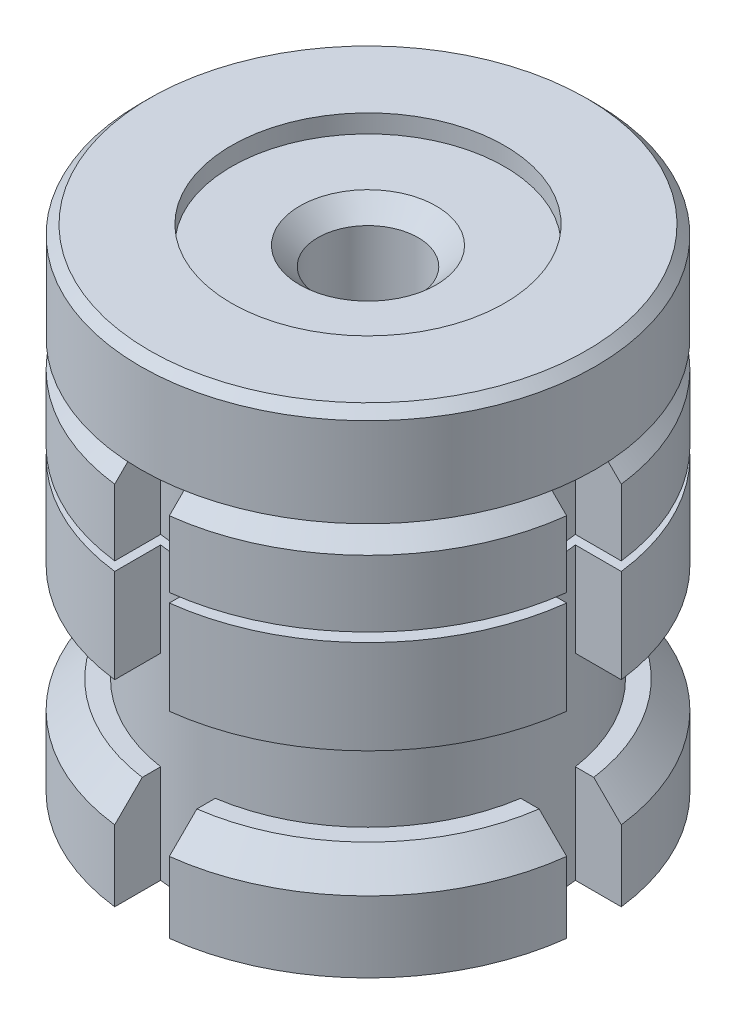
ISO-10303-21;
HEADER;
FILE_DESCRIPTION(('STEP AP214'),'2;1');
FILE_NAME('part.step','',(''),(''),'','','');
FILE_SCHEMA(('AUTOMOTIVE_DESIGN { 1 0 10303 214 1 1 1 1 }'));
ENDSEC;
DATA;
#1=APPLICATION_CONTEXT('core data for automotive mechanical design processes');
#2=APPLICATION_PROTOCOL_DEFINITION('international standard','automotive_design',2000,#1);
#3=PRODUCT_CONTEXT('',#1,'mechanical');
#4=PRODUCT('Part','Part','',(#3));
#5=PRODUCT_RELATED_PRODUCT_CATEGORY('part','',(#4));
#6=PRODUCT_DEFINITION_FORMATION('','',#4);
#7=PRODUCT_DEFINITION_CONTEXT('part definition',#1,'design');
#8=PRODUCT_DEFINITION('design','',#6,#7);
#9=PRODUCT_DEFINITION_SHAPE('','',#8);
#10=(LENGTH_UNIT() NAMED_UNIT(*) SI_UNIT(.MILLI.,.METRE.));
#11=(NAMED_UNIT(*) PLANE_ANGLE_UNIT() SI_UNIT($,.RADIAN.));
#12=(NAMED_UNIT(*) SI_UNIT($,.STERADIAN.) SOLID_ANGLE_UNIT());
#13=UNCERTAINTY_MEASURE_WITH_UNIT(LENGTH_MEASURE(1.E-05),#10,'distance_accuracy_value','');
#14=(GEOMETRIC_REPRESENTATION_CONTEXT(3) GLOBAL_UNCERTAINTY_ASSIGNED_CONTEXT((#13)) GLOBAL_UNIT_ASSIGNED_CONTEXT((#10,
#11,#12)) REPRESENTATION_CONTEXT('',''));
#15=CARTESIAN_POINT('',(0.,0.,0.));
#16=DIRECTION('',(0.,0.,1.));
#17=DIRECTION('',(1.,0.,0.));
#18=AXIS2_PLACEMENT_3D('',#15,#16,#17);
#19=CARTESIAN_POINT('',(0.,10.8,0.));
#20=DIRECTION('',(0.,-1.,0.));
#21=DIRECTION('',(0.,0.,-1.));
#22=AXIS2_PLACEMENT_3D('',#19,#20,#21);
#23=CYLINDRICAL_SURFACE('',#22,12.5);
#24=DIRECTION('',(0.,1.,0.));
#25=VECTOR('',#24,1.);
#26=CARTESIAN_POINT('',(-1.49999999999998,-14.7785048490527,12.4096736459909));
#27=LINE('',#26,#25);
#28=CARTESIAN_POINT('',(-1.49999999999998,5.65,12.4096736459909));
#29=VERTEX_POINT('',#28);
#30=CARTESIAN_POINT('',(-1.49999999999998,9.30000000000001,12.4096736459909));
#31=VERTEX_POINT('',#30);
#32=EDGE_CURVE('E1113',#29,#31,#27,.T.);
#33=ORIENTED_EDGE('',*,*,#32,.T.);
#34=CARTESIAN_POINT('',(0.,9.30000000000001,0.));
#35=DIRECTION('',(0.,1.,0.));
#36=DIRECTION('',(0.,0.,1.));
#37=AXIS2_PLACEMENT_3D('',#34,#35,#36);
#38=CIRCLE('',#37,12.5);
#39=CARTESIAN_POINT('',(-12.4096736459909,9.30000000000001,1.49999999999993));
#40=VERTEX_POINT('',#39);
#41=EDGE_CURVE('E55',#31,#40,#38,.F.);
#42=ORIENTED_EDGE('',*,*,#41,.T.);
#43=DIRECTION('',(0.,1.,0.));
#44=VECTOR('',#43,1.);
#45=CARTESIAN_POINT('',(-12.4096736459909,-14.7785048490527,1.49999999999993));
#46=LINE('',#45,#44);
#47=CARTESIAN_POINT('',(-12.4096736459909,5.65,1.49999999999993));
#48=VERTEX_POINT('',#47);
#49=EDGE_CURVE('E868',#48,#40,#46,.T.);
#50=ORIENTED_EDGE('',*,*,#49,.F.);
#51=CARTESIAN_POINT('',(0.,5.65,0.));
#52=DIRECTION('',(0.,1.,0.));
#53=DIRECTION('',(0.,0.,1.));
#54=AXIS2_PLACEMENT_3D('',#51,#52,#53);
#55=CIRCLE('',#54,12.5);
#56=EDGE_CURVE('E589',#48,#29,#55,.T.);
#57=ORIENTED_EDGE('',*,*,#56,.T.);
#58=EDGE_LOOP('',(#33,#42,#50,#57));
#59=FACE_BOUND('',#58,.T.);
#60=ADVANCED_FACE('F39',(#59),#23,.T.);
#61=DIRECTION('',(0.,1.,0.));
#62=VECTOR('',#61,1.);
#63=CARTESIAN_POINT('',(-12.4096736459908,-14.7785048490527,-1.50000000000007));
#64=LINE('',#63,#62);
#65=CARTESIAN_POINT('',(-12.4096736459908,5.65,-1.50000000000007));
#66=VERTEX_POINT('',#65);
#67=CARTESIAN_POINT('',(-12.4096736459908,9.30000000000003,-1.50000000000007));
#68=VERTEX_POINT('',#67);
#69=EDGE_CURVE('E886',#66,#68,#64,.T.);
#70=ORIENTED_EDGE('',*,*,#69,.T.);
#71=CARTESIAN_POINT('',(0.,9.30000000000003,0.));
#72=DIRECTION('',(0.,1.,0.));
#73=DIRECTION('',(0.,0.,1.));
#74=AXIS2_PLACEMENT_3D('',#71,#72,#73);
#75=CIRCLE('',#74,12.5);
#76=CARTESIAN_POINT('',(-1.49999999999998,9.30000000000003,-12.4096736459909));
#77=VERTEX_POINT('',#76);
#78=EDGE_CURVE('E647',#68,#77,#75,.F.);
#79=ORIENTED_EDGE('',*,*,#78,.T.);
#80=DIRECTION('',(0.,1.,0.));
#81=VECTOR('',#80,1.);
#82=CARTESIAN_POINT('',(-1.49999999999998,-14.7785048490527,-12.4096736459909));
#83=LINE('',#82,#81);
#84=CARTESIAN_POINT('',(-1.49999999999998,5.65,-12.4096736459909));
#85=VERTEX_POINT('',#84);
#86=EDGE_CURVE('E463',#85,#77,#83,.T.);
#87=ORIENTED_EDGE('',*,*,#86,.F.);
#88=EDGE_CURVE('E1226',#85,#66,#55,.T.);
#89=ORIENTED_EDGE('',*,*,#88,.T.);
#90=EDGE_LOOP('',(#70,#79,#87,#89));
#91=FACE_BOUND('',#90,.T.);
#92=ADVANCED_FACE('F1243',(#91),#23,.T.);
#93=DIRECTION('',(0.,1.,0.));
#94=VECTOR('',#93,1.);
#95=CARTESIAN_POINT('',(12.4096736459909,-14.7785048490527,1.49999999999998));
#96=LINE('',#95,#94);
#97=CARTESIAN_POINT('',(12.4096736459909,5.65,1.49999999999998));
#98=VERTEX_POINT('',#97);
#99=CARTESIAN_POINT('',(12.4096736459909,9.30000000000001,1.49999999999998));
#100=VERTEX_POINT('',#99);
#101=EDGE_CURVE('E1022',#98,#100,#96,.T.);
#102=ORIENTED_EDGE('',*,*,#101,.T.);
#103=CARTESIAN_POINT('',(0.,9.30000000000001,0.));
#104=DIRECTION('',(0.,1.,0.));
#105=DIRECTION('',(0.,0.,1.));
#106=AXIS2_PLACEMENT_3D('',#103,#104,#105);
#107=CIRCLE('',#106,12.5);
#108=CARTESIAN_POINT('',(1.49999999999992,9.30000000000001,12.4096736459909));
#109=VERTEX_POINT('',#108);
#110=EDGE_CURVE('E730',#100,#109,#107,.F.);
#111=ORIENTED_EDGE('',*,*,#110,.T.);
#112=DIRECTION('',(0.,1.,0.));
#113=VECTOR('',#112,1.);
#114=CARTESIAN_POINT('',(1.49999999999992,-14.7785048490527,12.4096736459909));
#115=LINE('',#114,#113);
#116=CARTESIAN_POINT('',(1.49999999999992,5.65,12.4096736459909));
#117=VERTEX_POINT('',#116);
#118=EDGE_CURVE('E1103',#117,#109,#115,.T.);
#119=ORIENTED_EDGE('',*,*,#118,.F.);
#120=EDGE_CURVE('E590',#117,#98,#55,.T.);
#121=ORIENTED_EDGE('',*,*,#120,.T.);
#122=EDGE_LOOP('',(#102,#111,#119,#121));
#123=FACE_BOUND('',#122,.T.);
#124=ADVANCED_FACE('F1101',(#123),#23,.T.);
#125=CARTESIAN_POINT('',(0.,5.65,12.5));
#126=DIRECTION('',(0.,1.,0.));
#127=DIRECTION('',(0.,0.,1.));
#128=AXIS2_PLACEMENT_3D('',#125,#126,#127);
#129=PLANE('',#128);
#130=CARTESIAN_POINT('',(0.,5.65,0.));
#131=DIRECTION('',(0.,1.,0.));
#132=DIRECTION('',(0.,0.,1.));
#133=AXIS2_PLACEMENT_3D('',#130,#131,#132);
#134=CIRCLE('',#133,7.5);
#135=CARTESIAN_POINT('',(0.,5.65,7.5));
#136=VERTEX_POINT('',#135);
#137=EDGE_CURVE('E594',#136,#136,#134,.T.);
#138=ORIENTED_EDGE('',*,*,#137,.T.);
#139=EDGE_LOOP('',(#138));
#140=FACE_BOUND('',#139,.T.);
#141=ORIENTED_EDGE('',*,*,#56,.F.);
#142=DIRECTION('',(1.,0.,0.));
#143=VECTOR('',#142,1.);
#144=CARTESIAN_POINT('',(0.,5.65,1.49999999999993));
#145=LINE('',#144,#143);
#146=CARTESIAN_POINT('',(-9.88685996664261,5.65,1.49999999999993));
#147=VERTEX_POINT('',#146);
#148=EDGE_CURVE('E564',#48,#147,#145,.T.);
#149=ORIENTED_EDGE('',*,*,#148,.T.);
#150=CARTESIAN_POINT('',(0.,5.65,0.));
#151=DIRECTION('',(0.,1.,0.));
#152=DIRECTION('',(0.,0.,1.));
#153=AXIS2_PLACEMENT_3D('',#150,#151,#152);
#154=CIRCLE('',#153,10.);
#155=CARTESIAN_POINT('',(-9.88685996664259,5.65,-1.50000000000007));
#156=VERTEX_POINT('',#155);
#157=EDGE_CURVE('E548',#147,#156,#154,.F.);
#158=ORIENTED_EDGE('',*,*,#157,.T.);
#159=DIRECTION('',(-1.,0.,0.));
#160=VECTOR('',#159,1.);
#161=CARTESIAN_POINT('',(0.,5.65,-1.50000000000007));
#162=LINE('',#161,#160);
#163=EDGE_CURVE('E541',#156,#66,#162,.T.);
#164=ORIENTED_EDGE('',*,*,#163,.T.);
#165=ORIENTED_EDGE('',*,*,#88,.F.);
#166=DIRECTION('',(0.,0.,1.));
#167=VECTOR('',#166,1.);
#168=CARTESIAN_POINT('',(-1.49999999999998,5.65,12.5));
#169=LINE('',#168,#167);
#170=CARTESIAN_POINT('',(-1.49999999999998,5.65,-9.8868599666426));
#171=VERTEX_POINT('',#170);
#172=EDGE_CURVE('E527',#85,#171,#169,.T.);
#173=ORIENTED_EDGE('',*,*,#172,.T.);
#174=CARTESIAN_POINT('',(0.,5.65,0.));
#175=DIRECTION('',(0.,1.,0.));
#176=DIRECTION('',(0.,0.,1.));
#177=AXIS2_PLACEMENT_3D('',#174,#175,#176);
#178=CIRCLE('',#177,10.);
#179=CARTESIAN_POINT('',(1.49999999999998,5.65,-9.8868599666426));
#180=VERTEX_POINT('',#179);
#181=EDGE_CURVE('E422',#171,#180,#178,.F.);
#182=ORIENTED_EDGE('',*,*,#181,.T.);
#183=DIRECTION('',(0.,0.,-1.));
#184=VECTOR('',#183,1.);
#185=CARTESIAN_POINT('',(1.49999999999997,5.65,12.5));
#186=LINE('',#185,#184);
#187=CARTESIAN_POINT('',(1.49999999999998,5.65,-12.4096736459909));
#188=VERTEX_POINT('',#187);
#189=EDGE_CURVE('E501',#180,#188,#186,.T.);
#190=ORIENTED_EDGE('',*,*,#189,.T.);
#191=CARTESIAN_POINT('',(12.4096736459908,5.65,-1.50000000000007));
#192=VERTEX_POINT('',#191);
#193=EDGE_CURVE('E595',#192,#188,#55,.T.);
#194=ORIENTED_EDGE('',*,*,#193,.F.);
#195=DIRECTION('',(-1.,0.,0.));
#196=VECTOR('',#195,1.);
#197=CARTESIAN_POINT('',(0.,5.65,-1.50000000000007));
#198=LINE('',#197,#196);
#199=CARTESIAN_POINT('',(9.88685996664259,5.65,-1.50000000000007));
#200=VERTEX_POINT('',#199);
#201=EDGE_CURVE('E1067',#192,#200,#198,.T.);
#202=ORIENTED_EDGE('',*,*,#201,.T.);
#203=CARTESIAN_POINT('',(0.,5.65,0.));
#204=DIRECTION('',(0.,1.,0.));
#205=DIRECTION('',(0.,0.,1.));
#206=AXIS2_PLACEMENT_3D('',#203,#204,#205);
#207=CIRCLE('',#206,10.);
#208=CARTESIAN_POINT('',(9.8868599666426,5.65,1.49999999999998));
#209=VERTEX_POINT('',#208);
#210=EDGE_CURVE('E1065',#200,#209,#207,.F.);
#211=ORIENTED_EDGE('',*,*,#210,.T.);
#212=DIRECTION('',(1.,0.,0.));
#213=VECTOR('',#212,1.);
#214=CARTESIAN_POINT('',(0.,5.65,1.49999999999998));
#215=LINE('',#214,#213);
#216=EDGE_CURVE('E992',#209,#98,#215,.T.);
#217=ORIENTED_EDGE('',*,*,#216,.T.);
#218=ORIENTED_EDGE('',*,*,#120,.F.);
#219=DIRECTION('',(0.,0.,-1.));
#220=VECTOR('',#219,1.);
#221=CARTESIAN_POINT('',(1.49999999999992,5.65,12.5));
#222=LINE('',#221,#220);
#223=CARTESIAN_POINT('',(1.49999999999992,5.65,9.8868599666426));
#224=VERTEX_POINT('',#223);
#225=EDGE_CURVE('E849',#117,#224,#222,.T.);
#226=ORIENTED_EDGE('',*,*,#225,.T.);
#227=CARTESIAN_POINT('',(0.,5.65,0.));
#228=DIRECTION('',(0.,1.,0.));
#229=DIRECTION('',(0.,0.,1.));
#230=AXIS2_PLACEMENT_3D('',#227,#228,#229);
#231=CIRCLE('',#230,10.);
#232=CARTESIAN_POINT('',(-1.49999999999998,5.65,9.8868599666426));
#233=VERTEX_POINT('',#232);
#234=EDGE_CURVE('E873',#224,#233,#231,.F.);
#235=ORIENTED_EDGE('',*,*,#234,.T.);
#236=DIRECTION('',(0.,0.,1.));
#237=VECTOR('',#236,1.);
#238=CARTESIAN_POINT('',(-1.49999999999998,5.65,12.5));
#239=LINE('',#238,#237);
#240=EDGE_CURVE('E1159',#233,#29,#239,.T.);
#241=ORIENTED_EDGE('',*,*,#240,.T.);
#242=EDGE_LOOP('',(#141,#149,#158,#164,#165,#173,#182,#190,#194,#202,#211,#217,#218,#226,#235,#241));
#243=FACE_BOUND('',#242,.T.);
#244=ADVANCED_FACE('F1071',(#140,#243),#129,.F.);
#245=CARTESIAN_POINT('',(0.,5.15,12.5));
#246=DIRECTION('',(0.,-1.,0.));
#247=DIRECTION('',(0.,0.,-1.));
#248=AXIS2_PLACEMENT_3D('',#245,#246,#247);
#249=PLANE('',#248);
#250=CARTESIAN_POINT('',(0.,5.15,0.));
#251=DIRECTION('',(0.,1.,0.));
#252=DIRECTION('',(0.,0.,1.));
#253=AXIS2_PLACEMENT_3D('',#250,#251,#252);
#254=CIRCLE('',#253,7.5);
#255=CARTESIAN_POINT('',(0.,5.15,7.5));
#256=VERTEX_POINT('',#255);
#257=EDGE_CURVE('E573',#256,#256,#254,.T.);
#258=ORIENTED_EDGE('',*,*,#257,.F.);
#259=EDGE_LOOP('',(#258));
#260=FACE_BOUND('',#259,.T.);
#261=CARTESIAN_POINT('',(0.,5.15,0.));
#262=DIRECTION('',(0.,-1.,0.));
#263=DIRECTION('',(0.,0.,-1.));
#264=AXIS2_PLACEMENT_3D('',#261,#262,#263);
#265=CIRCLE('',#264,10.);
#266=CARTESIAN_POINT('',(-9.88685996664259,5.15,-1.50000000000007));
#267=VERTEX_POINT('',#266);
#268=CARTESIAN_POINT('',(-9.88685996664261,5.15,1.49999999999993));
#269=VERTEX_POINT('',#268);
#270=EDGE_CURVE('E545',#267,#269,#265,.F.);
#271=ORIENTED_EDGE('',*,*,#270,.T.);
#272=DIRECTION('',(-1.,0.,0.));
#273=VECTOR('',#272,1.);
#274=CARTESIAN_POINT('',(0.,5.15,1.49999999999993));
#275=LINE('',#274,#273);
#276=CARTESIAN_POINT('',(-12.4096736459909,5.15,1.49999999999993));
#277=VERTEX_POINT('',#276);
#278=EDGE_CURVE('E560',#269,#277,#275,.T.);
#279=ORIENTED_EDGE('',*,*,#278,.T.);
#280=CARTESIAN_POINT('',(0.,5.15,0.));
#281=DIRECTION('',(0.,1.,0.));
#282=DIRECTION('',(0.,0.,1.));
#283=AXIS2_PLACEMENT_3D('',#280,#281,#282);
#284=CIRCLE('',#283,12.5);
#285=CARTESIAN_POINT('',(-1.49999999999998,5.15,12.4096736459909));
#286=VERTEX_POINT('',#285);
#287=EDGE_CURVE('E584',#277,#286,#284,.T.);
#288=ORIENTED_EDGE('',*,*,#287,.T.);
#289=DIRECTION('',(0.,0.,-1.));
#290=VECTOR('',#289,1.);
#291=CARTESIAN_POINT('',(-1.49999999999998,5.15,12.5));
#292=LINE('',#291,#290);
#293=CARTESIAN_POINT('',(-1.49999999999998,5.15,9.8868599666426));
#294=VERTEX_POINT('',#293);
#295=EDGE_CURVE('E1154',#286,#294,#292,.T.);
#296=ORIENTED_EDGE('',*,*,#295,.T.);
#297=CARTESIAN_POINT('',(0.,5.15,0.));
#298=DIRECTION('',(0.,-1.,0.));
#299=DIRECTION('',(0.,0.,-1.));
#300=AXIS2_PLACEMENT_3D('',#297,#298,#299);
#301=CIRCLE('',#300,10.);
#302=CARTESIAN_POINT('',(1.49999999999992,5.15,9.8868599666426));
#303=VERTEX_POINT('',#302);
#304=EDGE_CURVE('E865',#294,#303,#301,.F.);
#305=ORIENTED_EDGE('',*,*,#304,.T.);
#306=DIRECTION('',(0.,0.,1.));
#307=VECTOR('',#306,1.);
#308=CARTESIAN_POINT('',(1.49999999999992,5.15,12.5));
#309=LINE('',#308,#307);
#310=CARTESIAN_POINT('',(1.49999999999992,5.15,12.4096736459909));
#311=VERTEX_POINT('',#310);
#312=EDGE_CURVE('E1151',#303,#311,#309,.T.);
#313=ORIENTED_EDGE('',*,*,#312,.T.);
#314=CARTESIAN_POINT('',(12.4096736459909,5.15,1.49999999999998));
#315=VERTEX_POINT('',#314);
#316=EDGE_CURVE('E585',#311,#315,#284,.T.);
#317=ORIENTED_EDGE('',*,*,#316,.T.);
#318=DIRECTION('',(-1.,0.,0.));
#319=VECTOR('',#318,1.);
#320=CARTESIAN_POINT('',(0.,5.15,1.49999999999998));
#321=LINE('',#320,#319);
#322=CARTESIAN_POINT('',(9.8868599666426,5.15,1.49999999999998));
#323=VERTEX_POINT('',#322);
#324=EDGE_CURVE('E1090',#315,#323,#321,.T.);
#325=ORIENTED_EDGE('',*,*,#324,.T.);
#326=CARTESIAN_POINT('',(0.,5.15,0.));
#327=DIRECTION('',(0.,-1.,0.));
#328=DIRECTION('',(0.,0.,-1.));
#329=AXIS2_PLACEMENT_3D('',#326,#327,#328);
#330=CIRCLE('',#329,10.);
#331=CARTESIAN_POINT('',(9.88685996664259,5.15,-1.50000000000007));
#332=VERTEX_POINT('',#331);
#333=EDGE_CURVE('E1163',#323,#332,#330,.F.);
#334=ORIENTED_EDGE('',*,*,#333,.T.);
#335=DIRECTION('',(1.,0.,0.));
#336=VECTOR('',#335,1.);
#337=CARTESIAN_POINT('',(0.,5.15,-1.50000000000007));
#338=LINE('',#337,#336);
#339=CARTESIAN_POINT('',(12.4096736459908,5.15,-1.50000000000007));
#340=VERTEX_POINT('',#339);
#341=EDGE_CURVE('E1076',#332,#340,#338,.T.);
#342=ORIENTED_EDGE('',*,*,#341,.T.);
#343=CARTESIAN_POINT('',(1.49999999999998,5.15,-12.4096736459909));
#344=VERTEX_POINT('',#343);
#345=EDGE_CURVE('E499',#340,#344,#284,.T.);
#346=ORIENTED_EDGE('',*,*,#345,.T.);
#347=DIRECTION('',(0.,0.,1.));
#348=VECTOR('',#347,1.);
#349=CARTESIAN_POINT('',(1.49999999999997,5.15,12.5));
#350=LINE('',#349,#348);
#351=CARTESIAN_POINT('',(1.49999999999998,5.15,-9.8868599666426));
#352=VERTEX_POINT('',#351);
#353=EDGE_CURVE('E483',#344,#352,#350,.T.);
#354=ORIENTED_EDGE('',*,*,#353,.T.);
#355=CARTESIAN_POINT('',(0.,5.15,0.));
#356=DIRECTION('',(0.,-1.,0.));
#357=DIRECTION('',(0.,0.,-1.));
#358=AXIS2_PLACEMENT_3D('',#355,#356,#357);
#359=CIRCLE('',#358,10.);
#360=CARTESIAN_POINT('',(-1.49999999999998,5.15,-9.8868599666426));
#361=VERTEX_POINT('',#360);
#362=EDGE_CURVE('E496',#352,#361,#359,.F.);
#363=ORIENTED_EDGE('',*,*,#362,.T.);
#364=DIRECTION('',(0.,0.,-1.));
#365=VECTOR('',#364,1.);
#366=CARTESIAN_POINT('',(-1.49999999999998,5.15,12.5));
#367=LINE('',#366,#365);
#368=CARTESIAN_POINT('',(-1.49999999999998,5.15,-12.4096736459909));
#369=VERTEX_POINT('',#368);
#370=EDGE_CURVE('E525',#361,#369,#367,.T.);
#371=ORIENTED_EDGE('',*,*,#370,.T.);
#372=CARTESIAN_POINT('',(-12.4096736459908,5.15,-1.50000000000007));
#373=VERTEX_POINT('',#372);
#374=EDGE_CURVE('E1879',#369,#373,#284,.T.);
#375=ORIENTED_EDGE('',*,*,#374,.T.);
#376=DIRECTION('',(1.,0.,0.));
#377=VECTOR('',#376,1.);
#378=CARTESIAN_POINT('',(0.,5.15,-1.50000000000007));
#379=LINE('',#378,#377);
#380=EDGE_CURVE('E537',#373,#267,#379,.T.);
#381=ORIENTED_EDGE('',*,*,#380,.T.);
#382=EDGE_LOOP('',(#271,#279,#288,#296,#305,#313,#317,#325,#334,#342,#346,#354,#363,#371,#375,#381));
#383=FACE_BOUND('',#382,.T.);
#384=ADVANCED_FACE('F494',(#260,#383),#249,.F.);
#385=CARTESIAN_POINT('',(0.,0.,0.));
#386=DIRECTION('',(0.,1.,0.));
#387=DIRECTION('',(0.,0.,1.));
#388=AXIS2_PLACEMENT_3D('',#385,#386,#387);
#389=PLANE('',#388);
#390=CARTESIAN_POINT('',(0.,0.,0.));
#391=DIRECTION('',(0.,1.,0.));
#392=DIRECTION('',(0.,0.,1.));
#393=AXIS2_PLACEMENT_3D('',#390,#391,#392);
#394=CIRCLE('',#393,12.5);
#395=CARTESIAN_POINT('',(-12.4096736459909,0.,1.49999999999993));
#396=VERTEX_POINT('',#395);
#397=CARTESIAN_POINT('',(-1.49999999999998,0.,12.4096736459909));
#398=VERTEX_POINT('',#397);
#399=EDGE_CURVE('E599',#396,#398,#394,.T.);
#400=ORIENTED_EDGE('',*,*,#399,.F.);
#401=DIRECTION('',(1.,0.,0.));
#402=VECTOR('',#401,1.);
#403=CARTESIAN_POINT('',(0.,0.,1.49999999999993));
#404=LINE('',#403,#402);
#405=CARTESIAN_POINT('',(-9.88685996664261,0.,1.49999999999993));
#406=VERTEX_POINT('',#405);
#407=EDGE_CURVE('E556',#396,#406,#404,.T.);
#408=ORIENTED_EDGE('',*,*,#407,.T.);
#409=CARTESIAN_POINT('',(0.,0.,0.));
#410=DIRECTION('',(0.,-1.,0.));
#411=DIRECTION('',(0.,0.,-1.));
#412=AXIS2_PLACEMENT_3D('',#409,#410,#411);
#413=CIRCLE('',#412,10.);
#414=CARTESIAN_POINT('',(-1.49999999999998,0.,9.8868599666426));
#415=VERTEX_POINT('',#414);
#416=EDGE_CURVE('E1296',#415,#406,#413,.T.);
#417=ORIENTED_EDGE('',*,*,#416,.F.);
#418=DIRECTION('',(0.,0.,1.));
#419=VECTOR('',#418,1.);
#420=CARTESIAN_POINT('',(-1.49999999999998,0.,0.));
#421=LINE('',#420,#419);
#422=EDGE_CURVE('E848',#415,#398,#421,.T.);
#423=ORIENTED_EDGE('',*,*,#422,.T.);
#424=EDGE_LOOP('',(#400,#408,#417,#423));
#425=FACE_BOUND('',#424,.T.);
#426=ADVANCED_FACE('F1258',(#425),#389,.F.);
#427=CARTESIAN_POINT('',(-9.88685996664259,0.,-1.50000000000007));
#428=VERTEX_POINT('',#427);
#429=CARTESIAN_POINT('',(-1.49999999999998,0.,-9.8868599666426));
#430=VERTEX_POINT('',#429);
#431=EDGE_CURVE('E580',#428,#430,#413,.T.);
#432=ORIENTED_EDGE('',*,*,#431,.F.);
#433=DIRECTION('',(-1.,0.,0.));
#434=VECTOR('',#433,1.);
#435=CARTESIAN_POINT('',(0.,0.,-1.50000000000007));
#436=LINE('',#435,#434);
#437=CARTESIAN_POINT('',(-12.4096736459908,0.,-1.50000000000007));
#438=VERTEX_POINT('',#437);
#439=EDGE_CURVE('E533',#428,#438,#436,.T.);
#440=ORIENTED_EDGE('',*,*,#439,.T.);
#441=CARTESIAN_POINT('',(-1.49999999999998,0.,-12.4096736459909));
#442=VERTEX_POINT('',#441);
#443=EDGE_CURVE('E1284',#442,#438,#394,.T.);
#444=ORIENTED_EDGE('',*,*,#443,.F.);
#445=DIRECTION('',(0.,0.,1.));
#446=VECTOR('',#445,1.);
#447=CARTESIAN_POINT('',(-1.49999999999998,0.,0.));
#448=LINE('',#447,#446);
#449=EDGE_CURVE('E521',#442,#430,#448,.T.);
#450=ORIENTED_EDGE('',*,*,#449,.T.);
#451=EDGE_LOOP('',(#432,#440,#444,#450));
#452=FACE_BOUND('',#451,.T.);
#453=ADVANCED_FACE('F1465',(#452),#389,.F.);
#454=CARTESIAN_POINT('',(9.8868599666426,0.,1.49999999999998));
#455=VERTEX_POINT('',#454);
#456=CARTESIAN_POINT('',(1.49999999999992,0.,9.8868599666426));
#457=VERTEX_POINT('',#456);
#458=EDGE_CURVE('E579',#455,#457,#413,.T.);
#459=ORIENTED_EDGE('',*,*,#458,.F.);
#460=DIRECTION('',(1.,0.,0.));
#461=VECTOR('',#460,1.);
#462=CARTESIAN_POINT('',(0.,0.,1.49999999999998));
#463=LINE('',#462,#461);
#464=CARTESIAN_POINT('',(12.4096736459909,0.,1.49999999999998));
#465=VERTEX_POINT('',#464);
#466=EDGE_CURVE('E1080',#455,#465,#463,.T.);
#467=ORIENTED_EDGE('',*,*,#466,.T.);
#468=CARTESIAN_POINT('',(1.49999999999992,0.,12.4096736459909));
#469=VERTEX_POINT('',#468);
#470=EDGE_CURVE('E600',#469,#465,#394,.T.);
#471=ORIENTED_EDGE('',*,*,#470,.F.);
#472=DIRECTION('',(0.,0.,-1.));
#473=VECTOR('',#472,1.);
#474=CARTESIAN_POINT('',(1.49999999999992,0.,0.));
#475=LINE('',#474,#473);
#476=EDGE_CURVE('E1190',#469,#457,#475,.T.);
#477=ORIENTED_EDGE('',*,*,#476,.T.);
#478=EDGE_LOOP('',(#459,#467,#471,#477));
#479=FACE_BOUND('',#478,.T.);
#480=ADVANCED_FACE('F1189',(#479),#389,.F.);
#481=ORIENTED_EDGE('',*,*,#287,.F.);
#482=EDGE_CURVE('E866',#396,#277,#46,.T.);
#483=ORIENTED_EDGE('',*,*,#482,.F.);
#484=ORIENTED_EDGE('',*,*,#399,.T.);
#485=EDGE_CURVE('E1111',#398,#286,#27,.T.);
#486=ORIENTED_EDGE('',*,*,#485,.T.);
#487=EDGE_LOOP('',(#481,#483,#484,#486));
#488=FACE_BOUND('',#487,.T.);
#489=ADVANCED_FACE('F1275',(#488),#23,.T.);
#490=ORIENTED_EDGE('',*,*,#443,.T.);
#491=EDGE_CURVE('E884',#438,#373,#64,.T.);
#492=ORIENTED_EDGE('',*,*,#491,.T.);
#493=ORIENTED_EDGE('',*,*,#374,.F.);
#494=EDGE_CURVE('E958',#442,#369,#83,.T.);
#495=ORIENTED_EDGE('',*,*,#494,.F.);
#496=EDGE_LOOP('',(#490,#492,#493,#495));
#497=FACE_BOUND('',#496,.T.);
#498=ADVANCED_FACE('F1269',(#497),#23,.T.);
#499=ORIENTED_EDGE('',*,*,#470,.T.);
#500=EDGE_CURVE('E1021',#465,#315,#96,.T.);
#501=ORIENTED_EDGE('',*,*,#500,.T.);
#502=ORIENTED_EDGE('',*,*,#316,.F.);
#503=EDGE_CURVE('E1106',#469,#311,#115,.T.);
#504=ORIENTED_EDGE('',*,*,#503,.F.);
#505=EDGE_LOOP('',(#499,#501,#502,#504));
#506=FACE_BOUND('',#505,.T.);
#507=ADVANCED_FACE('F1185',(#506),#23,.T.);
#508=CARTESIAN_POINT('',(0.,-5.4,0.));
#509=DIRECTION('',(0.,-1.,0.));
#510=DIRECTION('',(0.,0.,-1.));
#511=AXIS2_PLACEMENT_3D('',#508,#509,#510);
#512=CYLINDRICAL_SURFACE('',#511,12.5);
#513=CARTESIAN_POINT('',(-1.49999999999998,-10.8,12.4096736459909));
#514=VERTEX_POINT('',#513);
#515=CARTESIAN_POINT('',(-1.49999999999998,-6.90000000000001,12.4096736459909));
#516=VERTEX_POINT('',#515);
#517=EDGE_CURVE('E859',#514,#516,#27,.T.);
#518=ORIENTED_EDGE('',*,*,#517,.T.);
#519=CARTESIAN_POINT('',(0.,-6.90000000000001,0.));
#520=DIRECTION('',(0.,-1.,0.));
#521=DIRECTION('',(0.,0.,-1.));
#522=AXIS2_PLACEMENT_3D('',#519,#520,#521);
#523=CIRCLE('',#522,12.5);
#524=CARTESIAN_POINT('',(-12.4096736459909,-6.90000000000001,1.49999999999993));
#525=VERTEX_POINT('',#524);
#526=EDGE_CURVE('E777',#516,#525,#523,.T.);
#527=ORIENTED_EDGE('',*,*,#526,.T.);
#528=CARTESIAN_POINT('',(-12.4096736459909,-10.8,1.49999999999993));
#529=VERTEX_POINT('',#528);
#530=EDGE_CURVE('E857',#529,#525,#46,.T.);
#531=ORIENTED_EDGE('',*,*,#530,.F.);
#532=CARTESIAN_POINT('',(0.,-10.8,0.));
#533=DIRECTION('',(0.,-1.,0.));
#534=DIRECTION('',(0.,0.,-1.));
#535=AXIS2_PLACEMENT_3D('',#532,#533,#534);
#536=CIRCLE('',#535,12.5);
#537=EDGE_CURVE('E1818',#514,#529,#536,.T.);
#538=ORIENTED_EDGE('',*,*,#537,.F.);
#539=EDGE_LOOP('',(#518,#527,#531,#538));
#540=FACE_BOUND('',#539,.T.);
#541=ADVANCED_FACE('F855',(#540),#512,.T.);
#542=CARTESIAN_POINT('',(-12.4096736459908,-10.8,-1.50000000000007));
#543=VERTEX_POINT('',#542);
#544=CARTESIAN_POINT('',(-12.4096736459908,-6.9,-1.50000000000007));
#545=VERTEX_POINT('',#544);
#546=EDGE_CURVE('E879',#543,#545,#64,.T.);
#547=ORIENTED_EDGE('',*,*,#546,.T.);
#548=CARTESIAN_POINT('',(0.,-6.9,0.));
#549=DIRECTION('',(0.,-1.,0.));
#550=DIRECTION('',(0.,0.,-1.));
#551=AXIS2_PLACEMENT_3D('',#548,#549,#550);
#552=CIRCLE('',#551,12.5);
#553=CARTESIAN_POINT('',(-1.49999999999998,-6.9,-12.4096736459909));
#554=VERTEX_POINT('',#553);
#555=EDGE_CURVE('E609',#545,#554,#552,.T.);
#556=ORIENTED_EDGE('',*,*,#555,.T.);
#557=CARTESIAN_POINT('',(-1.49999999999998,-10.8,-12.4096736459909));
#558=VERTEX_POINT('',#557);
#559=EDGE_CURVE('E954',#558,#554,#83,.T.);
#560=ORIENTED_EDGE('',*,*,#559,.F.);
#561=EDGE_CURVE('E568',#543,#558,#536,.T.);
#562=ORIENTED_EDGE('',*,*,#561,.F.);
#563=EDGE_LOOP('',(#547,#556,#560,#562));
#564=FACE_BOUND('',#563,.T.);
#565=ADVANCED_FACE('F1274',(#564),#512,.T.);
#566=CARTESIAN_POINT('',(12.4096736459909,-10.8,1.49999999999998));
#567=VERTEX_POINT('',#566);
#568=CARTESIAN_POINT('',(12.4096736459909,-6.90000000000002,1.49999999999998));
#569=VERTEX_POINT('',#568);
#570=EDGE_CURVE('E1015',#567,#569,#96,.T.);
#571=ORIENTED_EDGE('',*,*,#570,.T.);
#572=CARTESIAN_POINT('',(0.,-6.90000000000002,0.));
#573=DIRECTION('',(0.,-1.,0.));
#574=DIRECTION('',(0.,0.,-1.));
#575=AXIS2_PLACEMENT_3D('',#572,#573,#574);
#576=CIRCLE('',#575,12.5);
#577=CARTESIAN_POINT('',(1.49999999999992,-6.90000000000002,12.4096736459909));
#578=VERTEX_POINT('',#577);
#579=EDGE_CURVE('E748',#569,#578,#576,.T.);
#580=ORIENTED_EDGE('',*,*,#579,.T.);
#581=CARTESIAN_POINT('',(1.49999999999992,-10.8,12.4096736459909));
#582=VERTEX_POINT('',#581);
#583=EDGE_CURVE('E1108',#582,#578,#115,.T.);
#584=ORIENTED_EDGE('',*,*,#583,.F.);
#585=EDGE_CURVE('E574',#567,#582,#536,.T.);
#586=ORIENTED_EDGE('',*,*,#585,.F.);
#587=EDGE_LOOP('',(#571,#580,#584,#586));
#588=FACE_BOUND('',#587,.T.);
#589=ADVANCED_FACE('F1256',(#588),#512,.T.);
#590=CARTESIAN_POINT('',(0.,-5.4,0.));
#591=DIRECTION('',(0.,-1.,0.));
#592=DIRECTION('',(0.,0.,-1.));
#593=AXIS2_PLACEMENT_3D('',#590,#591,#592);
#594=PLANE('',#593);
#595=DIRECTION('',(-1.,0.,0.));
#596=VECTOR('',#595,1.);
#597=CARTESIAN_POINT('',(0.,-5.4,1.49999999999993));
#598=LINE('',#597,#596);
#599=CARTESIAN_POINT('',(-9.88685996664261,-5.4,1.49999999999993));
#600=VERTEX_POINT('',#599);
#601=CARTESIAN_POINT('',(-10.8972473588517,-5.4,1.49999999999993));
#602=VERTEX_POINT('',#601);
#603=EDGE_CURVE('E552',#600,#602,#598,.T.);
#604=ORIENTED_EDGE('',*,*,#603,.T.);
#605=CARTESIAN_POINT('',(0.,-5.4,0.));
#606=DIRECTION('',(0.,-1.,0.));
#607=DIRECTION('',(0.,0.,-1.));
#608=AXIS2_PLACEMENT_3D('',#605,#606,#607);
#609=CIRCLE('',#608,11.);
#610=CARTESIAN_POINT('',(-1.49999999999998,-5.4,10.8972473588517));
#611=VERTEX_POINT('',#610);
#612=EDGE_CURVE('E787',#602,#611,#609,.F.);
#613=ORIENTED_EDGE('',*,*,#612,.T.);
#614=DIRECTION('',(0.,0.,-1.));
#615=VECTOR('',#614,1.);
#616=CARTESIAN_POINT('',(-1.49999999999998,-5.4,0.));
#617=LINE('',#616,#615);
#618=CARTESIAN_POINT('',(-1.49999999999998,-5.4,9.8868599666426));
#619=VERTEX_POINT('',#618);
#620=EDGE_CURVE('E841',#611,#619,#617,.T.);
#621=ORIENTED_EDGE('',*,*,#620,.T.);
#622=CARTESIAN_POINT('',(0.,-5.4,0.));
#623=DIRECTION('',(0.,-1.,0.));
#624=DIRECTION('',(0.,0.,-1.));
#625=AXIS2_PLACEMENT_3D('',#622,#623,#624);
#626=CIRCLE('',#625,10.);
#627=EDGE_CURVE('E1819',#619,#600,#626,.T.);
#628=ORIENTED_EDGE('',*,*,#627,.T.);
#629=EDGE_LOOP('',(#604,#613,#621,#628));
#630=FACE_BOUND('',#629,.T.);
#631=ADVANCED_FACE('F839',(#630),#594,.F.);
#632=DIRECTION('',(0.,0.,-1.));
#633=VECTOR('',#632,1.);
#634=CARTESIAN_POINT('',(-1.49999999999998,-5.4,0.));
#635=LINE('',#634,#633);
#636=CARTESIAN_POINT('',(-1.49999999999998,-5.4,-9.8868599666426));
#637=VERTEX_POINT('',#636);
#638=CARTESIAN_POINT('',(-1.49999999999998,-5.4,-10.8972473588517));
#639=VERTEX_POINT('',#638);
#640=EDGE_CURVE('E517',#637,#639,#635,.T.);
#641=ORIENTED_EDGE('',*,*,#640,.T.);
#642=CARTESIAN_POINT('',(0.,-5.4,0.));
#643=DIRECTION('',(0.,-1.,0.));
#644=DIRECTION('',(0.,0.,-1.));
#645=AXIS2_PLACEMENT_3D('',#642,#643,#644);
#646=CIRCLE('',#645,11.);
#647=CARTESIAN_POINT('',(-10.8972473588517,-5.4,-1.50000000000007));
#648=VERTEX_POINT('',#647);
#649=EDGE_CURVE('E622',#639,#648,#646,.F.);
#650=ORIENTED_EDGE('',*,*,#649,.T.);
#651=DIRECTION('',(1.,0.,0.));
#652=VECTOR('',#651,1.);
#653=CARTESIAN_POINT('',(0.,-5.4,-1.50000000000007));
#654=LINE('',#653,#652);
#655=CARTESIAN_POINT('',(-9.88685996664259,-5.4,-1.50000000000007));
#656=VERTEX_POINT('',#655);
#657=EDGE_CURVE('E530',#648,#656,#654,.T.);
#658=ORIENTED_EDGE('',*,*,#657,.T.);
#659=EDGE_CURVE('E578',#656,#637,#626,.T.);
#660=ORIENTED_EDGE('',*,*,#659,.T.);
#661=EDGE_LOOP('',(#641,#650,#658,#660));
#662=FACE_BOUND('',#661,.T.);
#663=ADVANCED_FACE('F1327',(#662),#594,.F.);
#664=DIRECTION('',(0.,0.,1.));
#665=VECTOR('',#664,1.);
#666=CARTESIAN_POINT('',(1.49999999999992,-5.4,0.));
#667=LINE('',#666,#665);
#668=CARTESIAN_POINT('',(1.49999999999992,-5.4,9.8868599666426));
#669=VERTEX_POINT('',#668);
#670=CARTESIAN_POINT('',(1.49999999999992,-5.4,10.8972473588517));
#671=VERTEX_POINT('',#670);
#672=EDGE_CURVE('E1214',#669,#671,#667,.T.);
#673=ORIENTED_EDGE('',*,*,#672,.T.);
#674=CARTESIAN_POINT('',(0.,-5.4,0.));
#675=DIRECTION('',(0.,-1.,0.));
#676=DIRECTION('',(0.,0.,-1.));
#677=AXIS2_PLACEMENT_3D('',#674,#675,#676);
#678=CIRCLE('',#677,11.);
#679=CARTESIAN_POINT('',(10.8972473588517,-5.4,1.49999999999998));
#680=VERTEX_POINT('',#679);
#681=EDGE_CURVE('E768',#671,#680,#678,.F.);
#682=ORIENTED_EDGE('',*,*,#681,.T.);
#683=DIRECTION('',(-1.,0.,0.));
#684=VECTOR('',#683,1.);
#685=CARTESIAN_POINT('',(0.,-5.4,1.49999999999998));
#686=LINE('',#685,#684);
#687=CARTESIAN_POINT('',(9.8868599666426,-5.4,1.49999999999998));
#688=VERTEX_POINT('',#687);
#689=EDGE_CURVE('E1075',#680,#688,#686,.T.);
#690=ORIENTED_EDGE('',*,*,#689,.T.);
#691=EDGE_CURVE('E610',#688,#669,#626,.T.);
#692=ORIENTED_EDGE('',*,*,#691,.T.);
#693=EDGE_LOOP('',(#673,#682,#690,#692));
#694=FACE_BOUND('',#693,.T.);
#695=ADVANCED_FACE('F1322',(#694),#594,.F.);
#696=CARTESIAN_POINT('',(0.,-10.8,0.));
#697=DIRECTION('',(0.,-1.,0.));
#698=DIRECTION('',(0.,0.,-1.));
#699=AXIS2_PLACEMENT_3D('',#696,#697,#698);
#700=PLANE('',#699);
#701=CARTESIAN_POINT('',(0.,-10.8,0.));
#702=DIRECTION('',(0.,-1.,0.));
#703=DIRECTION('',(0.,0.,-1.));
#704=AXIS2_PLACEMENT_3D('',#701,#702,#703);
#705=CIRCLE('',#704,3.75000000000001);
#706=CARTESIAN_POINT('',(0.,-10.8,-3.75000000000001));
#707=VERTEX_POINT('',#706);
#708=EDGE_CURVE('E1300',#707,#707,#705,.F.);
#709=ORIENTED_EDGE('',*,*,#708,.T.);
#710=EDGE_LOOP('',(#709));
#711=FACE_BOUND('',#710,.T.);
#712=DIRECTION('',(1.,0.,0.));
#713=VECTOR('',#712,1.);
#714=CARTESIAN_POINT('',(-9.88685996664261,-10.8,1.49999999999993));
#715=LINE('',#714,#713);
#716=CARTESIAN_POINT('',(-9.88685996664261,-10.8,1.49999999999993));
#717=VERTEX_POINT('',#716);
#718=EDGE_CURVE('E863',#529,#717,#715,.T.);
#719=ORIENTED_EDGE('',*,*,#718,.T.);
#720=CARTESIAN_POINT('',(0.,-10.8,0.));
#721=DIRECTION('',(0.,-1.,0.));
#722=DIRECTION('',(0.,0.,-1.));
#723=AXIS2_PLACEMENT_3D('',#720,#721,#722);
#724=CIRCLE('',#723,10.);
#725=CARTESIAN_POINT('',(-9.88685996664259,-10.8,-1.50000000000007));
#726=VERTEX_POINT('',#725);
#727=EDGE_CURVE('E915',#717,#726,#724,.T.);
#728=ORIENTED_EDGE('',*,*,#727,.T.);
#729=DIRECTION('',(-1.,0.,0.));
#730=VECTOR('',#729,1.);
#731=CARTESIAN_POINT('',(-12.4096736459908,-10.8,-1.50000000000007));
#732=LINE('',#731,#730);
#733=EDGE_CURVE('E897',#726,#543,#732,.T.);
#734=ORIENTED_EDGE('',*,*,#733,.T.);
#735=ORIENTED_EDGE('',*,*,#561,.T.);
#736=DIRECTION('',(0.,0.,1.));
#737=VECTOR('',#736,1.);
#738=CARTESIAN_POINT('',(-1.49999999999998,-10.8,-12.4096736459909));
#739=LINE('',#738,#737);
#740=CARTESIAN_POINT('',(-1.49999999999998,-10.8,-9.8868599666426));
#741=VERTEX_POINT('',#740);
#742=EDGE_CURVE('E425',#558,#741,#739,.T.);
#743=ORIENTED_EDGE('',*,*,#742,.T.);
#744=CARTESIAN_POINT('',(0.,-10.8,0.));
#745=DIRECTION('',(0.,-1.,0.));
#746=DIRECTION('',(0.,0.,-1.));
#747=AXIS2_PLACEMENT_3D('',#744,#745,#746);
#748=CIRCLE('',#747,10.);
#749=CARTESIAN_POINT('',(1.49999999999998,-10.8,-9.8868599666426));
#750=VERTEX_POINT('',#749);
#751=EDGE_CURVE('E439',#741,#750,#748,.T.);
#752=ORIENTED_EDGE('',*,*,#751,.T.);
#753=DIRECTION('',(0.,0.,-1.));
#754=VECTOR('',#753,1.);
#755=CARTESIAN_POINT('',(1.49999999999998,-10.8,-9.8868599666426));
#756=LINE('',#755,#754);
#757=CARTESIAN_POINT('',(1.49999999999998,-10.8,-12.4096736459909));
#758=VERTEX_POINT('',#757);
#759=EDGE_CURVE('E459',#750,#758,#756,.T.);
#760=ORIENTED_EDGE('',*,*,#759,.T.);
#761=CARTESIAN_POINT('',(12.4096736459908,-10.8,-1.50000000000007));
#762=VERTEX_POINT('',#761);
#763=EDGE_CURVE('E569',#758,#762,#536,.T.);
#764=ORIENTED_EDGE('',*,*,#763,.T.);
#765=DIRECTION('',(-1.,0.,0.));
#766=VECTOR('',#765,1.);
#767=CARTESIAN_POINT('',(9.88685996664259,-10.8,-1.50000000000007));
#768=LINE('',#767,#766);
#769=CARTESIAN_POINT('',(9.88685996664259,-10.8,-1.50000000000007));
#770=VERTEX_POINT('',#769);
#771=EDGE_CURVE('E1003',#762,#770,#768,.T.);
#772=ORIENTED_EDGE('',*,*,#771,.T.);
#773=CARTESIAN_POINT('',(0.,-10.8,0.));
#774=DIRECTION('',(0.,-1.,0.));
#775=DIRECTION('',(0.,0.,-1.));
#776=AXIS2_PLACEMENT_3D('',#773,#774,#775);
#777=CIRCLE('',#776,10.);
#778=CARTESIAN_POINT('',(9.8868599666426,-10.8,1.49999999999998));
#779=VERTEX_POINT('',#778);
#780=EDGE_CURVE('E1050',#770,#779,#777,.T.);
#781=ORIENTED_EDGE('',*,*,#780,.T.);
#782=DIRECTION('',(1.,0.,0.));
#783=VECTOR('',#782,1.);
#784=CARTESIAN_POINT('',(12.4096736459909,-10.8,1.49999999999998));
#785=LINE('',#784,#783);
#786=EDGE_CURVE('E1032',#779,#567,#785,.T.);
#787=ORIENTED_EDGE('',*,*,#786,.T.);
#788=ORIENTED_EDGE('',*,*,#585,.T.);
#789=DIRECTION('',(0.,0.,-1.));
#790=VECTOR('',#789,1.);
#791=CARTESIAN_POINT('',(1.49999999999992,-10.8,12.4096736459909));
#792=LINE('',#791,#790);
#793=CARTESIAN_POINT('',(1.49999999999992,-10.8,9.8868599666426));
#794=VERTEX_POINT('',#793);
#795=EDGE_CURVE('E1116',#582,#794,#792,.T.);
#796=ORIENTED_EDGE('',*,*,#795,.T.);
#797=CARTESIAN_POINT('',(0.,-10.8,0.));
#798=DIRECTION('',(0.,-1.,0.));
#799=DIRECTION('',(0.,0.,-1.));
#800=AXIS2_PLACEMENT_3D('',#797,#798,#799);
#801=CIRCLE('',#800,10.);
#802=CARTESIAN_POINT('',(-1.49999999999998,-10.8,9.8868599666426));
#803=VERTEX_POINT('',#802);
#804=EDGE_CURVE('E1130',#794,#803,#801,.T.);
#805=ORIENTED_EDGE('',*,*,#804,.T.);
#806=DIRECTION('',(0.,0.,1.));
#807=VECTOR('',#806,1.);
#808=CARTESIAN_POINT('',(-1.49999999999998,-10.8,9.8868599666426));
#809=LINE('',#808,#807);
#810=EDGE_CURVE('E1198',#803,#514,#809,.T.);
#811=ORIENTED_EDGE('',*,*,#810,.T.);
#812=ORIENTED_EDGE('',*,*,#537,.T.);
#813=EDGE_LOOP('',(#719,#728,#734,#735,#743,#752,#760,#764,#772,#781,#787,#788,#796,#805,#811,#812));
#814=FACE_BOUND('',#813,.T.);
#815=ADVANCED_FACE('F1266',(#711,#814),#700,.T.);
#816=CARTESIAN_POINT('',(0.,-10.8,0.));
#817=DIRECTION('',(0.,1.,0.));
#818=DIRECTION('',(0.,0.,1.));
#819=AXIS2_PLACEMENT_3D('',#816,#817,#818);
#820=CYLINDRICAL_SURFACE('',#819,10.);
#821=DIRECTION('',(0.,1.,0.));
#822=VECTOR('',#821,1.);
#823=CARTESIAN_POINT('',(-9.88685996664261,-14.7785048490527,1.49999999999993));
#824=LINE('',#823,#822);
#825=EDGE_CURVE('E917',#717,#600,#824,.T.);
#826=ORIENTED_EDGE('',*,*,#825,.T.);
#827=ORIENTED_EDGE('',*,*,#627,.F.);
#828=DIRECTION('',(0.,1.,0.));
#829=VECTOR('',#828,1.);
#830=CARTESIAN_POINT('',(-1.49999999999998,-14.7785048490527,9.8868599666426));
#831=LINE('',#830,#829);
#832=EDGE_CURVE('E846',#803,#619,#831,.T.);
#833=ORIENTED_EDGE('',*,*,#832,.F.);
#834=ORIENTED_EDGE('',*,*,#804,.F.);
#835=DIRECTION('',(0.,1.,0.));
#836=VECTOR('',#835,1.);
#837=CARTESIAN_POINT('',(1.49999999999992,-14.7785048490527,9.8868599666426));
#838=LINE('',#837,#836);
#839=EDGE_CURVE('E1128',#794,#669,#838,.T.);
#840=ORIENTED_EDGE('',*,*,#839,.T.);
#841=ORIENTED_EDGE('',*,*,#691,.F.);
#842=DIRECTION('',(0.,1.,0.));
#843=VECTOR('',#842,1.);
#844=CARTESIAN_POINT('',(9.8868599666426,-14.7785048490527,1.49999999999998));
#845=LINE('',#844,#843);
#846=EDGE_CURVE('E418',#779,#688,#845,.T.);
#847=ORIENTED_EDGE('',*,*,#846,.F.);
#848=ORIENTED_EDGE('',*,*,#780,.F.);
#849=DIRECTION('',(0.,1.,0.));
#850=VECTOR('',#849,1.);
#851=CARTESIAN_POINT('',(9.88685996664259,-14.7785048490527,-1.50000000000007));
#852=LINE('',#851,#850);
#853=CARTESIAN_POINT('',(9.88685996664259,-5.4,-1.50000000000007));
#854=VERTEX_POINT('',#853);
#855=EDGE_CURVE('E1053',#770,#854,#852,.T.);
#856=ORIENTED_EDGE('',*,*,#855,.T.);
#857=CARTESIAN_POINT('',(1.49999999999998,-5.4,-9.8868599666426));
#858=VERTEX_POINT('',#857);
#859=EDGE_CURVE('E605',#858,#854,#626,.T.);
#860=ORIENTED_EDGE('',*,*,#859,.F.);
#861=DIRECTION('',(0.,1.,0.));
#862=VECTOR('',#861,1.);
#863=CARTESIAN_POINT('',(1.49999999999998,-14.7785048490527,-9.8868599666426));
#864=LINE('',#863,#862);
#865=EDGE_CURVE('E456',#750,#858,#864,.T.);
#866=ORIENTED_EDGE('',*,*,#865,.F.);
#867=ORIENTED_EDGE('',*,*,#751,.F.);
#868=DIRECTION('',(0.,1.,0.));
#869=VECTOR('',#868,1.);
#870=CARTESIAN_POINT('',(-1.49999999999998,-14.7785048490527,-9.8868599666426));
#871=LINE('',#870,#869);
#872=EDGE_CURVE('E427',#741,#637,#871,.T.);
#873=ORIENTED_EDGE('',*,*,#872,.T.);
#874=ORIENTED_EDGE('',*,*,#659,.F.);
#875=DIRECTION('',(0.,1.,0.));
#876=VECTOR('',#875,1.);
#877=CARTESIAN_POINT('',(-9.88685996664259,-14.7785048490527,-1.50000000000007));
#878=LINE('',#877,#876);
#879=EDGE_CURVE('E904',#726,#656,#878,.T.);
#880=ORIENTED_EDGE('',*,*,#879,.F.);
#881=ORIENTED_EDGE('',*,*,#727,.F.);
#882=EDGE_LOOP('',(#826,#827,#833,#834,#840,#841,#847,#848,#856,#860,#866,#867,#873,#874,#880,#881));
#883=FACE_BOUND('',#882,.T.);
#884=ORIENTED_EDGE('',*,*,#416,.T.);
#885=EDGE_CURVE('E924',#406,#269,#824,.T.);
#886=ORIENTED_EDGE('',*,*,#885,.T.);
#887=ORIENTED_EDGE('',*,*,#270,.F.);
#888=EDGE_CURVE('E911',#428,#267,#878,.T.);
#889=ORIENTED_EDGE('',*,*,#888,.F.);
#890=ORIENTED_EDGE('',*,*,#431,.T.);
#891=EDGE_CURVE('E424',#430,#361,#871,.T.);
#892=ORIENTED_EDGE('',*,*,#891,.T.);
#893=ORIENTED_EDGE('',*,*,#362,.F.);
#894=CARTESIAN_POINT('',(1.49999999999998,0.,-9.8868599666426));
#895=VERTEX_POINT('',#894);
#896=EDGE_CURVE('E455',#895,#352,#864,.T.);
#897=ORIENTED_EDGE('',*,*,#896,.F.);
#898=CARTESIAN_POINT('',(9.88685996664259,0.,-1.50000000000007));
#899=VERTEX_POINT('',#898);
#900=EDGE_CURVE('E575',#895,#899,#413,.T.);
#901=ORIENTED_EDGE('',*,*,#900,.T.);
#902=EDGE_CURVE('E1055',#899,#332,#852,.T.);
#903=ORIENTED_EDGE('',*,*,#902,.T.);
#904=ORIENTED_EDGE('',*,*,#333,.F.);
#905=EDGE_CURVE('E1183',#455,#323,#845,.T.);
#906=ORIENTED_EDGE('',*,*,#905,.F.);
#907=ORIENTED_EDGE('',*,*,#458,.T.);
#908=EDGE_CURVE('E1127',#457,#303,#838,.T.);
#909=ORIENTED_EDGE('',*,*,#908,.T.);
#910=ORIENTED_EDGE('',*,*,#304,.F.);
#911=EDGE_CURVE('E1210',#415,#294,#831,.T.);
#912=ORIENTED_EDGE('',*,*,#911,.F.);
#913=EDGE_LOOP('',(#884,#886,#887,#889,#890,#892,#893,#897,#901,#903,#904,#906,#907,#909,#910,#912));
#914=FACE_BOUND('',#913,.T.);
#915=ADVANCED_FACE('F1142',(#883,#914),#820,.T.);
#916=DIRECTION('',(0.,1.,0.));
#917=VECTOR('',#916,1.);
#918=CARTESIAN_POINT('',(1.49999999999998,-14.7785048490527,-12.4096736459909));
#919=LINE('',#918,#917);
#920=CARTESIAN_POINT('',(1.49999999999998,9.30000000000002,-12.4096736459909));
#921=VERTEX_POINT('',#920);
#922=EDGE_CURVE('E465',#188,#921,#919,.T.);
#923=ORIENTED_EDGE('',*,*,#922,.T.);
#924=CARTESIAN_POINT('',(0.,9.30000000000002,0.));
#925=DIRECTION('',(0.,1.,0.));
#926=DIRECTION('',(0.,0.,1.));
#927=AXIS2_PLACEMENT_3D('',#924,#925,#926);
#928=CIRCLE('',#927,12.5);
#929=CARTESIAN_POINT('',(12.4096736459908,9.30000000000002,-1.50000000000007));
#930=VERTEX_POINT('',#929);
#931=EDGE_CURVE('E724',#921,#930,#928,.F.);
#932=ORIENTED_EDGE('',*,*,#931,.T.);
#933=DIRECTION('',(0.,1.,0.));
#934=VECTOR('',#933,1.);
#935=CARTESIAN_POINT('',(12.4096736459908,-14.7785048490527,-1.50000000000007));
#936=LINE('',#935,#934);
#937=EDGE_CURVE('E1007',#192,#930,#936,.T.);
#938=ORIENTED_EDGE('',*,*,#937,.F.);
#939=ORIENTED_EDGE('',*,*,#193,.T.);
#940=EDGE_LOOP('',(#923,#932,#938,#939));
#941=FACE_BOUND('',#940,.T.);
#942=ADVANCED_FACE('F1233',(#941),#23,.T.);
#943=CARTESIAN_POINT('',(0.,13.2647697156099,0.));
#944=DIRECTION('',(0.,1.,0.));
#945=DIRECTION('',(0.,0.,1.));
#946=AXIS2_PLACEMENT_3D('',#943,#944,#945);
#947=CYLINDRICAL_SURFACE('',#946,7.5);
#948=ORIENTED_EDGE('',*,*,#137,.F.);
#949=EDGE_LOOP('',(#948));
#950=FACE_BOUND('',#949,.T.);
#951=ORIENTED_EDGE('',*,*,#257,.T.);
#952=EDGE_LOOP('',(#951));
#953=FACE_BOUND('',#952,.T.);
#954=ADVANCED_FACE('F1257',(#950,#953),#947,.T.);
#955=ORIENTED_EDGE('',*,*,#900,.F.);
#956=DIRECTION('',(0.,0.,-1.));
#957=VECTOR('',#956,1.);
#958=CARTESIAN_POINT('',(1.49999999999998,0.,0.));
#959=LINE('',#958,#957);
#960=CARTESIAN_POINT('',(1.49999999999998,0.,-12.4096736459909));
#961=VERTEX_POINT('',#960);
#962=EDGE_CURVE('E486',#895,#961,#959,.T.);
#963=ORIENTED_EDGE('',*,*,#962,.T.);
#964=CARTESIAN_POINT('',(12.4096736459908,0.,-1.50000000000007));
#965=VERTEX_POINT('',#964);
#966=EDGE_CURVE('E604',#965,#961,#394,.T.);
#967=ORIENTED_EDGE('',*,*,#966,.F.);
#968=DIRECTION('',(-1.,0.,0.));
#969=VECTOR('',#968,1.);
#970=CARTESIAN_POINT('',(0.,0.,-1.50000000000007));
#971=LINE('',#970,#969);
#972=EDGE_CURVE('E1083',#965,#899,#971,.T.);
#973=ORIENTED_EDGE('',*,*,#972,.T.);
#974=EDGE_LOOP('',(#955,#963,#967,#973));
#975=FACE_BOUND('',#974,.T.);
#976=ADVANCED_FACE('F1176',(#975),#389,.F.);
#977=ORIENTED_EDGE('',*,*,#966,.T.);
#978=EDGE_CURVE('E464',#961,#344,#919,.T.);
#979=ORIENTED_EDGE('',*,*,#978,.T.);
#980=ORIENTED_EDGE('',*,*,#345,.F.);
#981=EDGE_CURVE('E1005',#965,#340,#936,.T.);
#982=ORIENTED_EDGE('',*,*,#981,.F.);
#983=EDGE_LOOP('',(#977,#979,#980,#982));
#984=FACE_BOUND('',#983,.T.);
#985=ADVANCED_FACE('F1244',(#984),#23,.T.);
#986=CARTESIAN_POINT('',(1.49999999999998,-6.90000000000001,-12.4096736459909));
#987=VERTEX_POINT('',#986);
#988=EDGE_CURVE('E460',#758,#987,#919,.T.);
#989=ORIENTED_EDGE('',*,*,#988,.T.);
#990=CARTESIAN_POINT('',(0.,-6.90000000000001,0.));
#991=DIRECTION('',(0.,-1.,0.));
#992=DIRECTION('',(0.,0.,-1.));
#993=AXIS2_PLACEMENT_3D('',#990,#991,#992);
#994=CIRCLE('',#993,12.5);
#995=CARTESIAN_POINT('',(12.4096736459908,-6.90000000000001,-1.50000000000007));
#996=VERTEX_POINT('',#995);
#997=EDGE_CURVE('E692',#987,#996,#994,.T.);
#998=ORIENTED_EDGE('',*,*,#997,.T.);
#999=EDGE_CURVE('E999',#762,#996,#936,.T.);
#1000=ORIENTED_EDGE('',*,*,#999,.F.);
#1001=ORIENTED_EDGE('',*,*,#763,.F.);
#1002=EDGE_LOOP('',(#989,#998,#1000,#1001));
#1003=FACE_BOUND('',#1002,.T.);
#1004=ADVANCED_FACE('F997',(#1003),#512,.T.);
#1005=DIRECTION('',(1.,0.,0.));
#1006=VECTOR('',#1005,1.);
#1007=CARTESIAN_POINT('',(0.,-5.4,-1.50000000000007));
#1008=LINE('',#1007,#1006);
#1009=CARTESIAN_POINT('',(10.8972473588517,-5.4,-1.50000000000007));
#1010=VERTEX_POINT('',#1009);
#1011=EDGE_CURVE('E988',#854,#1010,#1008,.T.);
#1012=ORIENTED_EDGE('',*,*,#1011,.T.);
#1013=CARTESIAN_POINT('',(0.,-5.4,0.));
#1014=DIRECTION('',(0.,-1.,0.));
#1015=DIRECTION('',(0.,0.,-1.));
#1016=AXIS2_PLACEMENT_3D('',#1013,#1014,#1015);
#1017=CIRCLE('',#1016,11.);
#1018=CARTESIAN_POINT('',(1.49999999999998,-5.4,-10.8972473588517));
#1019=VERTEX_POINT('',#1018);
#1020=EDGE_CURVE('E702',#1010,#1019,#1017,.F.);
#1021=ORIENTED_EDGE('',*,*,#1020,.T.);
#1022=DIRECTION('',(0.,0.,1.));
#1023=VECTOR('',#1022,1.);
#1024=CARTESIAN_POINT('',(1.49999999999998,-5.4,0.));
#1025=LINE('',#1024,#1023);
#1026=EDGE_CURVE('E509',#1019,#858,#1025,.T.);
#1027=ORIENTED_EDGE('',*,*,#1026,.T.);
#1028=ORIENTED_EDGE('',*,*,#859,.T.);
#1029=EDGE_LOOP('',(#1012,#1021,#1027,#1028));
#1030=FACE_BOUND('',#1029,.T.);
#1031=ADVANCED_FACE('F987',(#1030),#594,.F.);
#1032=CARTESIAN_POINT('',(1.49999999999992,-14.7785048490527,12.4096736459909));
#1033=DIRECTION('',(1.,0.,0.));
#1034=DIRECTION('',(0.,0.,-1.));
#1035=AXIS2_PLACEMENT_3D('',#1032,#1033,#1034);
#1036=PLANE('',#1035);
#1037=ORIENTED_EDGE('',*,*,#583,.T.);
#1038=CARTESIAN_POINT('',(1.49999999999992,-6.90000000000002,12.4096736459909));
#1039=CARTESIAN_POINT('',(1.49999999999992,-6.64986616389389,12.1577353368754));
#1040=CARTESIAN_POINT('',(1.49999999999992,-6.39979924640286,11.9057306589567));
#1041=CARTESIAN_POINT('',(1.49999999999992,-5.89979924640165,11.4015885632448));
#1042=CARTESIAN_POINT('',(1.49999999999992,-5.64986616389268,11.1494511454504));
#1043=CARTESIAN_POINT('',(1.49999999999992,-5.4,10.8972473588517));
#1044=B_SPLINE_CURVE_WITH_KNOTS('',3,(#1038,#1039,#1040,#1041,#1042,#1043),.UNSPECIFIED.,.F.,
.F.,(4,2,4),(0.,1.06506262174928,2.13012525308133),.UNSPECIFIED.);
#1045=EDGE_CURVE('E762',#578,#671,#1044,.T.);
#1046=ORIENTED_EDGE('',*,*,#1045,.T.);
#1047=ORIENTED_EDGE('',*,*,#672,.F.);
#1048=ORIENTED_EDGE('',*,*,#839,.F.);
#1049=ORIENTED_EDGE('',*,*,#795,.F.);
#1050=EDGE_LOOP('',(#1037,#1046,#1047,#1048,#1049));
#1051=FACE_BOUND('',#1050,.T.);
#1052=ADVANCED_FACE('F758',(#1051),#1036,.F.);
#1053=CARTESIAN_POINT('',(-1.49999999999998,-14.7785048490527,9.8868599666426));
#1054=DIRECTION('',(-1.,0.,0.));
#1055=DIRECTION('',(0.,0.,1.));
#1056=AXIS2_PLACEMENT_3D('',#1053,#1054,#1055);
#1057=PLANE('',#1056);
#1058=ORIENTED_EDGE('',*,*,#620,.F.);
#1059=CARTESIAN_POINT('',(-1.49999999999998,-5.4,10.8972473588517));
#1060=CARTESIAN_POINT('',(-1.49999999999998,-5.64986616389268,11.1494511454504));
#1061=CARTESIAN_POINT('',(-1.49999999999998,-5.89979924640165,11.4015885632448));
#1062=CARTESIAN_POINT('',(-1.49999999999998,-6.39979924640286,11.9057306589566));
#1063=CARTESIAN_POINT('',(-1.49999999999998,-6.64986616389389,12.1577353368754));
#1064=CARTESIAN_POINT('',(-1.49999999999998,-6.90000000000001,12.4096736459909));
#1065=B_SPLINE_CURVE_WITH_KNOTS('',3,(#1059,#1060,#1061,#1062,#1063,#1064),.UNSPECIFIED.,.F.,
.F.,(4,2,4),(0.,1.06506263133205,2.13012525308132),.UNSPECIFIED.);
#1066=EDGE_CURVE('E823',#611,#516,#1065,.T.);
#1067=ORIENTED_EDGE('',*,*,#1066,.T.);
#1068=ORIENTED_EDGE('',*,*,#517,.F.);
#1069=ORIENTED_EDGE('',*,*,#810,.F.);
#1070=ORIENTED_EDGE('',*,*,#832,.T.);
#1071=EDGE_LOOP('',(#1058,#1067,#1068,#1069,#1070));
#1072=FACE_BOUND('',#1071,.T.);
#1073=ADVANCED_FACE('F844',(#1072),#1057,.F.);
#1074=CARTESIAN_POINT('',(9.88685996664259,-14.7785048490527,-1.50000000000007));
#1075=DIRECTION('',(0.,0.,-1.));
#1076=DIRECTION('',(-1.,0.,0.));
#1077=AXIS2_PLACEMENT_3D('',#1074,#1075,#1076);
#1078=PLANE('',#1077);
#1079=ORIENTED_EDGE('',*,*,#999,.T.);
#1080=CARTESIAN_POINT('',(12.4096736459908,-6.90000000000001,-1.50000000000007));
#1081=CARTESIAN_POINT('',(12.1577353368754,-6.64986616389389,-1.50000000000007));
#1082=CARTESIAN_POINT('',(11.9057306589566,-6.39979924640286,-1.50000000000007));
#1083=CARTESIAN_POINT('',(11.4015885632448,-5.89979924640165,-1.50000000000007));
#1084=CARTESIAN_POINT('',(11.1494511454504,-5.64986616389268,-1.50000000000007));
#1085=CARTESIAN_POINT('',(10.8972473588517,-5.4,-1.50000000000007));
#1086=B_SPLINE_CURVE_WITH_KNOTS('',3,(#1080,#1081,#1082,#1083,#1084,#1085),.UNSPECIFIED.,.F.,
.F.,(4,2,4),(0.,1.06506262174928,2.13012525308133),.UNSPECIFIED.);
#1087=EDGE_CURVE('E696',#996,#1010,#1086,.T.);
#1088=ORIENTED_EDGE('',*,*,#1087,.T.);
#1089=ORIENTED_EDGE('',*,*,#1011,.F.);
#1090=ORIENTED_EDGE('',*,*,#855,.F.);
#1091=ORIENTED_EDGE('',*,*,#771,.F.);
#1092=EDGE_LOOP('',(#1079,#1088,#1089,#1090,#1091));
#1093=FACE_BOUND('',#1092,.T.);
#1094=ADVANCED_FACE('F711',(#1093),#1078,.F.);
#1095=CARTESIAN_POINT('',(12.4096736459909,-14.7785048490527,1.49999999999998));
#1096=DIRECTION('',(0.,0.,1.));
#1097=DIRECTION('',(1.,0.,0.));
#1098=AXIS2_PLACEMENT_3D('',#1095,#1096,#1097);
#1099=PLANE('',#1098);
#1100=ORIENTED_EDGE('',*,*,#689,.F.);
#1101=CARTESIAN_POINT('',(10.8972473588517,-5.4,1.49999999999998));
#1102=CARTESIAN_POINT('',(11.1494511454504,-5.64986616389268,1.49999999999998));
#1103=CARTESIAN_POINT('',(11.4015885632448,-5.89979924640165,1.49999999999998));
#1104=CARTESIAN_POINT('',(11.9057306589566,-6.39979924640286,1.49999999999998));
#1105=CARTESIAN_POINT('',(12.1577353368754,-6.64986616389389,1.49999999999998));
#1106=CARTESIAN_POINT('',(12.4096736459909,-6.90000000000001,1.49999999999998));
#1107=B_SPLINE_CURVE_WITH_KNOTS('',3,(#1101,#1102,#1103,#1104,#1105,#1106),.UNSPECIFIED.,.F.,
.F.,(4,2,4),(0.,1.06506263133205,2.13012525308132),.UNSPECIFIED.);
#1108=EDGE_CURVE('E771',#680,#569,#1107,.T.);
#1109=ORIENTED_EDGE('',*,*,#1108,.T.);
#1110=ORIENTED_EDGE('',*,*,#570,.F.);
#1111=ORIENTED_EDGE('',*,*,#786,.F.);
#1112=ORIENTED_EDGE('',*,*,#846,.T.);
#1113=EDGE_LOOP('',(#1100,#1109,#1110,#1111,#1112));
#1114=FACE_BOUND('',#1113,.T.);
#1115=ADVANCED_FACE('F1394',(#1114),#1099,.F.);
#1116=CARTESIAN_POINT('',(1.49999999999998,-14.7785048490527,-9.8868599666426));
#1117=DIRECTION('',(1.,0.,0.));
#1118=DIRECTION('',(0.,0.,-1.));
#1119=AXIS2_PLACEMENT_3D('',#1116,#1117,#1118);
#1120=PLANE('',#1119);
#1121=ORIENTED_EDGE('',*,*,#1026,.F.);
#1122=CARTESIAN_POINT('',(1.49999999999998,-5.4,-10.8972473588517));
#1123=CARTESIAN_POINT('',(1.49999999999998,-5.64986616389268,-11.1494511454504));
#1124=CARTESIAN_POINT('',(1.49999999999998,-5.89979924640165,-11.4015885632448));
#1125=CARTESIAN_POINT('',(1.49999999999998,-6.39979924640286,-11.9057306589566));
#1126=CARTESIAN_POINT('',(1.49999999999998,-6.64986616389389,-12.1577353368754));
#1127=CARTESIAN_POINT('',(1.49999999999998,-6.90000000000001,-12.4096736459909));
#1128=B_SPLINE_CURVE_WITH_KNOTS('',3,(#1122,#1123,#1124,#1125,#1126,#1127),.UNSPECIFIED.,.F.,
.F.,(4,2,4),(0.,1.06506263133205,2.13012525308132),.UNSPECIFIED.);
#1129=EDGE_CURVE('E977',#1019,#987,#1128,.T.);
#1130=ORIENTED_EDGE('',*,*,#1129,.T.);
#1131=ORIENTED_EDGE('',*,*,#988,.F.);
#1132=ORIENTED_EDGE('',*,*,#759,.F.);
#1133=ORIENTED_EDGE('',*,*,#865,.T.);
#1134=EDGE_LOOP('',(#1121,#1130,#1131,#1132,#1133));
#1135=FACE_BOUND('',#1134,.T.);
#1136=ADVANCED_FACE('F990',(#1135),#1120,.F.);
#1137=CARTESIAN_POINT('',(-1.49999999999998,-14.7785048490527,-12.4096736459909));
#1138=DIRECTION('',(-1.,0.,0.));
#1139=DIRECTION('',(0.,0.,1.));
#1140=AXIS2_PLACEMENT_3D('',#1137,#1138,#1139);
#1141=PLANE('',#1140);
#1142=ORIENTED_EDGE('',*,*,#559,.T.);
#1143=CARTESIAN_POINT('',(-1.49999999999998,-6.9,-12.4096736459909));
#1144=CARTESIAN_POINT('',(-1.49999999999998,-6.64986616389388,-12.1577353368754));
#1145=CARTESIAN_POINT('',(-1.49999999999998,-6.39979924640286,-11.9057306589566));
#1146=CARTESIAN_POINT('',(-1.49999999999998,-5.89979924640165,-11.4015885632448));
#1147=CARTESIAN_POINT('',(-1.49999999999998,-5.64986616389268,-11.1494511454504));
#1148=CARTESIAN_POINT('',(-1.49999999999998,-5.4,-10.8972473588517));
#1149=B_SPLINE_CURVE_WITH_KNOTS('',3,(#1143,#1144,#1145,#1146,#1147,#1148),.UNSPECIFIED.,.F.,
.F.,(4,2,4),(0.,1.06506262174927,2.13012525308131),.UNSPECIFIED.);
#1150=EDGE_CURVE('E614',#554,#639,#1149,.T.);
#1151=ORIENTED_EDGE('',*,*,#1150,.T.);
#1152=ORIENTED_EDGE('',*,*,#640,.F.);
#1153=ORIENTED_EDGE('',*,*,#872,.F.);
#1154=ORIENTED_EDGE('',*,*,#742,.F.);
#1155=EDGE_LOOP('',(#1142,#1151,#1152,#1153,#1154));
#1156=FACE_BOUND('',#1155,.T.);
#1157=ADVANCED_FACE('F634',(#1156),#1141,.F.);
#1158=CARTESIAN_POINT('',(-12.4096736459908,-14.7785048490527,-1.50000000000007));
#1159=DIRECTION('',(0.,0.,-1.));
#1160=DIRECTION('',(-1.,0.,0.));
#1161=AXIS2_PLACEMENT_3D('',#1158,#1159,#1160);
#1162=PLANE('',#1161);
#1163=ORIENTED_EDGE('',*,*,#657,.F.);
#1164=CARTESIAN_POINT('',(-10.8972473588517,-5.4,-1.50000000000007));
#1165=CARTESIAN_POINT('',(-11.1494511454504,-5.64986616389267,-1.50000000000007));
#1166=CARTESIAN_POINT('',(-11.4015885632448,-5.89979924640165,-1.50000000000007));
#1167=CARTESIAN_POINT('',(-11.9057306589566,-6.39979924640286,-1.50000000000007));
#1168=CARTESIAN_POINT('',(-12.1577353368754,-6.64986616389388,-1.50000000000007));
#1169=CARTESIAN_POINT('',(-12.4096736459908,-6.9,-1.50000000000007));
#1170=B_SPLINE_CURVE_WITH_KNOTS('',3,(#1164,#1165,#1166,#1167,#1168,#1169),.UNSPECIFIED.,.F.,
.F.,(4,2,4),(0.,1.06506263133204,2.13012525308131),.UNSPECIFIED.);
#1171=EDGE_CURVE('E686',#648,#545,#1170,.T.);
#1172=ORIENTED_EDGE('',*,*,#1171,.T.);
#1173=ORIENTED_EDGE('',*,*,#546,.F.);
#1174=ORIENTED_EDGE('',*,*,#733,.F.);
#1175=ORIENTED_EDGE('',*,*,#879,.T.);
#1176=EDGE_LOOP('',(#1163,#1172,#1173,#1174,#1175));
#1177=FACE_BOUND('',#1176,.T.);
#1178=ADVANCED_FACE('F681',(#1177),#1162,.F.);
#1179=CARTESIAN_POINT('',(-9.88685996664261,-14.7785048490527,1.49999999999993));
#1180=DIRECTION('',(0.,0.,1.));
#1181=DIRECTION('',(1.,0.,0.));
#1182=AXIS2_PLACEMENT_3D('',#1179,#1180,#1181);
#1183=PLANE('',#1182);
#1184=ORIENTED_EDGE('',*,*,#530,.T.);
#1185=CARTESIAN_POINT('',(-12.4096736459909,-6.90000000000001,1.49999999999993));
#1186=CARTESIAN_POINT('',(-12.1577353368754,-6.64986616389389,1.49999999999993));
#1187=CARTESIAN_POINT('',(-11.9057306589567,-6.39979924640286,1.49999999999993));
#1188=CARTESIAN_POINT('',(-11.4015885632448,-5.89979924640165,1.49999999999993));
#1189=CARTESIAN_POINT('',(-11.1494511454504,-5.64986616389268,1.49999999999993));
#1190=CARTESIAN_POINT('',(-10.8972473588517,-5.4,1.49999999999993));
#1191=B_SPLINE_CURVE_WITH_KNOTS('',3,(#1185,#1186,#1187,#1188,#1189,#1190),.UNSPECIFIED.,.F.,
.F.,(4,2,4),(0.,1.06506262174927,2.13012525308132),.UNSPECIFIED.);
#1192=EDGE_CURVE('E781',#525,#602,#1191,.T.);
#1193=ORIENTED_EDGE('',*,*,#1192,.T.);
#1194=ORIENTED_EDGE('',*,*,#603,.F.);
#1195=ORIENTED_EDGE('',*,*,#825,.F.);
#1196=ORIENTED_EDGE('',*,*,#718,.F.);
#1197=EDGE_LOOP('',(#1184,#1193,#1194,#1195,#1196));
#1198=FACE_BOUND('',#1197,.T.);
#1199=ADVANCED_FACE('F798',(#1198),#1183,.F.);
#1200=ORIENTED_EDGE('',*,*,#908,.F.);
#1201=ORIENTED_EDGE('',*,*,#476,.F.);
#1202=ORIENTED_EDGE('',*,*,#503,.T.);
#1203=ORIENTED_EDGE('',*,*,#312,.F.);
#1204=EDGE_LOOP('',(#1200,#1201,#1202,#1203));
#1205=FACE_BOUND('',#1204,.T.);
#1206=ADVANCED_FACE('F757',(#1205),#1036,.F.);
#1207=ORIENTED_EDGE('',*,*,#485,.F.);
#1208=ORIENTED_EDGE('',*,*,#422,.F.);
#1209=ORIENTED_EDGE('',*,*,#911,.T.);
#1210=ORIENTED_EDGE('',*,*,#295,.F.);
#1211=EDGE_LOOP('',(#1207,#1208,#1209,#1210));
#1212=FACE_BOUND('',#1211,.T.);
#1213=ADVANCED_FACE('F1297',(#1212),#1057,.F.);
#1214=ORIENTED_EDGE('',*,*,#902,.F.);
#1215=ORIENTED_EDGE('',*,*,#972,.F.);
#1216=ORIENTED_EDGE('',*,*,#981,.T.);
#1217=ORIENTED_EDGE('',*,*,#341,.F.);
#1218=EDGE_LOOP('',(#1214,#1215,#1216,#1217));
#1219=FACE_BOUND('',#1218,.T.);
#1220=ADVANCED_FACE('F710',(#1219),#1078,.F.);
#1221=ORIENTED_EDGE('',*,*,#500,.F.);
#1222=ORIENTED_EDGE('',*,*,#466,.F.);
#1223=ORIENTED_EDGE('',*,*,#905,.T.);
#1224=ORIENTED_EDGE('',*,*,#324,.F.);
#1225=EDGE_LOOP('',(#1221,#1222,#1223,#1224));
#1226=FACE_BOUND('',#1225,.T.);
#1227=ADVANCED_FACE('F1182',(#1226),#1099,.F.);
#1228=ORIENTED_EDGE('',*,*,#891,.F.);
#1229=ORIENTED_EDGE('',*,*,#449,.F.);
#1230=ORIENTED_EDGE('',*,*,#494,.T.);
#1231=ORIENTED_EDGE('',*,*,#370,.F.);
#1232=EDGE_LOOP('',(#1228,#1229,#1230,#1231));
#1233=FACE_BOUND('',#1232,.T.);
#1234=ADVANCED_FACE('F633',(#1233),#1141,.F.);
#1235=ORIENTED_EDGE('',*,*,#978,.F.);
#1236=ORIENTED_EDGE('',*,*,#962,.F.);
#1237=ORIENTED_EDGE('',*,*,#896,.T.);
#1238=ORIENTED_EDGE('',*,*,#353,.F.);
#1239=EDGE_LOOP('',(#1235,#1236,#1237,#1238));
#1240=FACE_BOUND('',#1239,.T.);
#1241=ADVANCED_FACE('F482',(#1240),#1120,.F.);
#1242=ORIENTED_EDGE('',*,*,#885,.F.);
#1243=ORIENTED_EDGE('',*,*,#407,.F.);
#1244=ORIENTED_EDGE('',*,*,#482,.T.);
#1245=ORIENTED_EDGE('',*,*,#278,.F.);
#1246=EDGE_LOOP('',(#1242,#1243,#1244,#1245));
#1247=FACE_BOUND('',#1246,.T.);
#1248=ADVANCED_FACE('F797',(#1247),#1183,.F.);
#1249=ORIENTED_EDGE('',*,*,#491,.F.);
#1250=ORIENTED_EDGE('',*,*,#439,.F.);
#1251=ORIENTED_EDGE('',*,*,#888,.T.);
#1252=ORIENTED_EDGE('',*,*,#380,.F.);
#1253=EDGE_LOOP('',(#1249,#1250,#1251,#1252));
#1254=FACE_BOUND('',#1253,.T.);
#1255=ADVANCED_FACE('F680',(#1254),#1162,.F.);
#1256=DIRECTION('',(0.,0.,1.));
#1257=VECTOR('',#1256,1.);
#1258=CARTESIAN_POINT('',(-1.49999999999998,10.8,9.8868599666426));
#1259=LINE('',#1258,#1257);
#1260=CARTESIAN_POINT('',(-1.49999999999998,10.8,9.8868599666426));
#1261=VERTEX_POINT('',#1260);
#1262=CARTESIAN_POINT('',(-1.49999999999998,10.8,10.8972473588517));
#1263=VERTEX_POINT('',#1262);
#1264=EDGE_CURVE('E1199',#1261,#1263,#1259,.T.);
#1265=ORIENTED_EDGE('',*,*,#1264,.T.);
#1266=CARTESIAN_POINT('',(-1.49999999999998,10.8,10.8972473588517));
#1267=CARTESIAN_POINT('',(-1.49999999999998,10.5501338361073,11.1494511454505));
#1268=CARTESIAN_POINT('',(-1.49999999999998,10.3002007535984,11.4015885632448));
#1269=CARTESIAN_POINT('',(-1.49999999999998,9.80020075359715,11.9057306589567));
#1270=CARTESIAN_POINT('',(-1.49999999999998,9.55013383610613,12.1577353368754));
#1271=CARTESIAN_POINT('',(-1.49999999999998,9.30000000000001,12.4096736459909));
#1272=B_SPLINE_CURVE_WITH_KNOTS('',3,(#1266,#1267,#1268,#1269,#1270,#1271),.UNSPECIFIED.,.F.,
.F.,(4,2,4),(0.,1.06506263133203,2.13012525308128),.UNSPECIFIED.);
#1273=EDGE_CURVE('E63',#1263,#31,#1272,.T.);
#1274=ORIENTED_EDGE('',*,*,#1273,.T.);
#1275=ORIENTED_EDGE('',*,*,#32,.F.);
#1276=ORIENTED_EDGE('',*,*,#240,.F.);
#1277=EDGE_CURVE('E1137',#233,#1261,#831,.T.);
#1278=ORIENTED_EDGE('',*,*,#1277,.T.);
#1279=EDGE_LOOP('',(#1265,#1274,#1275,#1276,#1278));
#1280=FACE_BOUND('',#1279,.T.);
#1281=ADVANCED_FACE('F755',(#1280),#1057,.F.);
#1282=ORIENTED_EDGE('',*,*,#118,.T.);
#1283=CARTESIAN_POINT('',(1.49999999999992,9.30000000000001,12.4096736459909));
#1284=CARTESIAN_POINT('',(1.49999999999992,9.55013383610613,12.1577353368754));
#1285=CARTESIAN_POINT('',(1.49999999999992,9.80020075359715,11.9057306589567));
#1286=CARTESIAN_POINT('',(1.49999999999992,10.3002007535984,11.4015885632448));
#1287=CARTESIAN_POINT('',(1.49999999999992,10.5501338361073,11.1494511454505));
#1288=CARTESIAN_POINT('',(1.49999999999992,10.8,10.8972473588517));
#1289=B_SPLINE_CURVE_WITH_KNOTS('',3,(#1283,#1284,#1285,#1286,#1287,#1288),.UNSPECIFIED.,.F.,
.F.,(4,2,4),(0.,1.06506262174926,2.13012525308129),.UNSPECIFIED.);
#1290=CARTESIAN_POINT('',(1.49999999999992,10.8,10.8972473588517));
#1291=VERTEX_POINT('',#1290);
#1292=EDGE_CURVE('E741',#109,#1291,#1289,.T.);
#1293=ORIENTED_EDGE('',*,*,#1292,.T.);
#1294=DIRECTION('',(0.,0.,-1.));
#1295=VECTOR('',#1294,1.);
#1296=CARTESIAN_POINT('',(1.49999999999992,10.8,12.4096736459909));
#1297=LINE('',#1296,#1295);
#1298=CARTESIAN_POINT('',(1.49999999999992,10.8,9.8868599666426));
#1299=VERTEX_POINT('',#1298);
#1300=EDGE_CURVE('E1194',#1291,#1299,#1297,.T.);
#1301=ORIENTED_EDGE('',*,*,#1300,.T.);
#1302=EDGE_CURVE('E1121',#224,#1299,#838,.T.);
#1303=ORIENTED_EDGE('',*,*,#1302,.F.);
#1304=ORIENTED_EDGE('',*,*,#225,.F.);
#1305=EDGE_LOOP('',(#1282,#1293,#1301,#1303,#1304));
#1306=FACE_BOUND('',#1305,.T.);
#1307=ADVANCED_FACE('F750',(#1306),#1036,.F.);
#1308=CARTESIAN_POINT('',(0.,-14.7785048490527,0.));
#1309=DIRECTION('',(0.,1.,0.));
#1310=DIRECTION('',(0.,0.,1.));
#1311=AXIS2_PLACEMENT_3D('',#1308,#1309,#1310);
#1312=CYLINDRICAL_SURFACE('',#1311,10.);
#1313=ORIENTED_EDGE('',*,*,#1302,.T.);
#1314=CARTESIAN_POINT('',(0.,10.8,0.));
#1315=DIRECTION('',(0.,-1.,0.));
#1316=DIRECTION('',(0.,0.,1.));
#1317=AXIS2_PLACEMENT_3D('',#1314,#1315,#1316);
#1318=CIRCLE('',#1317,10.);
#1319=EDGE_CURVE('E1201',#1299,#1261,#1318,.T.);
#1320=ORIENTED_EDGE('',*,*,#1319,.T.);
#1321=ORIENTED_EDGE('',*,*,#1277,.F.);
#1322=ORIENTED_EDGE('',*,*,#234,.F.);
#1323=EDGE_LOOP('',(#1313,#1320,#1321,#1322));
#1324=FACE_BOUND('',#1323,.T.);
#1325=ADVANCED_FACE('F754',(#1324),#1312,.T.);
#1326=DIRECTION('',(1.,0.,0.));
#1327=VECTOR('',#1326,1.);
#1328=CARTESIAN_POINT('',(12.4096736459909,10.8,1.49999999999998));
#1329=LINE('',#1328,#1327);
#1330=CARTESIAN_POINT('',(9.8868599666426,10.8,1.49999999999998));
#1331=VERTEX_POINT('',#1330);
#1332=CARTESIAN_POINT('',(10.8972473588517,10.8,1.49999999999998));
#1333=VERTEX_POINT('',#1332);
#1334=EDGE_CURVE('E1045',#1331,#1333,#1329,.T.);
#1335=ORIENTED_EDGE('',*,*,#1334,.T.);
#1336=CARTESIAN_POINT('',(10.8972473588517,10.8,1.49999999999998));
#1337=CARTESIAN_POINT('',(11.1494511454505,10.5501338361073,1.49999999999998));
#1338=CARTESIAN_POINT('',(11.4015885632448,10.3002007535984,1.49999999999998));
#1339=CARTESIAN_POINT('',(11.9057306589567,9.80020075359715,1.49999999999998));
#1340=CARTESIAN_POINT('',(12.1577353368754,9.55013383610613,1.49999999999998));
#1341=CARTESIAN_POINT('',(12.4096736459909,9.30000000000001,1.49999999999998));
#1342=B_SPLINE_CURVE_WITH_KNOTS('',3,(#1336,#1337,#1338,#1339,#1340,#1341),.UNSPECIFIED.,.F.,
.F.,(4,2,4),(0.,1.06506263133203,2.13012525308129),.UNSPECIFIED.);
#1343=EDGE_CURVE('E723',#1333,#100,#1342,.T.);
#1344=ORIENTED_EDGE('',*,*,#1343,.T.);
#1345=ORIENTED_EDGE('',*,*,#101,.F.);
#1346=ORIENTED_EDGE('',*,*,#216,.F.);
#1347=EDGE_CURVE('E1052',#209,#1331,#845,.T.);
#1348=ORIENTED_EDGE('',*,*,#1347,.T.);
#1349=EDGE_LOOP('',(#1335,#1344,#1345,#1346,#1348));
#1350=FACE_BOUND('',#1349,.T.);
#1351=ADVANCED_FACE('F708',(#1350),#1099,.F.);
#1352=ORIENTED_EDGE('',*,*,#937,.T.);
#1353=CARTESIAN_POINT('',(12.4096736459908,9.30000000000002,-1.50000000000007));
#1354=CARTESIAN_POINT('',(12.1577353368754,9.55013383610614,-1.50000000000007));
#1355=CARTESIAN_POINT('',(11.9057306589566,9.80020075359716,-1.50000000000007));
#1356=CARTESIAN_POINT('',(11.4015885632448,10.3002007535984,-1.50000000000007));
#1357=CARTESIAN_POINT('',(11.1494511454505,10.5501338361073,-1.50000000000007));
#1358=CARTESIAN_POINT('',(10.8972473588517,10.8,-1.50000000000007));
#1359=B_SPLINE_CURVE_WITH_KNOTS('',3,(#1353,#1354,#1355,#1356,#1357,#1358),.UNSPECIFIED.,.F.,
.F.,(4,2,4),(0.,1.06506262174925,2.13012525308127),.UNSPECIFIED.);
#1360=CARTESIAN_POINT('',(10.8972473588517,10.8,-1.50000000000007));
#1361=VERTEX_POINT('',#1360);
#1362=EDGE_CURVE('E716',#930,#1361,#1359,.T.);
#1363=ORIENTED_EDGE('',*,*,#1362,.T.);
#1364=DIRECTION('',(-1.,0.,0.));
#1365=VECTOR('',#1364,1.);
#1366=CARTESIAN_POINT('',(9.88685996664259,10.8,-1.50000000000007));
#1367=LINE('',#1366,#1365);
#1368=CARTESIAN_POINT('',(9.88685996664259,10.8,-1.50000000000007));
#1369=VERTEX_POINT('',#1368);
#1370=EDGE_CURVE('E1037',#1361,#1369,#1367,.T.);
#1371=ORIENTED_EDGE('',*,*,#1370,.T.);
#1372=EDGE_CURVE('E1009',#200,#1369,#852,.T.);
#1373=ORIENTED_EDGE('',*,*,#1372,.F.);
#1374=ORIENTED_EDGE('',*,*,#201,.F.);
#1375=EDGE_LOOP('',(#1352,#1363,#1371,#1373,#1374));
#1376=FACE_BOUND('',#1375,.T.);
#1377=ADVANCED_FACE('F704',(#1376),#1078,.F.);
#1378=CARTESIAN_POINT('',(0.,-14.7785048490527,0.));
#1379=DIRECTION('',(0.,1.,0.));
#1380=DIRECTION('',(0.,0.,1.));
#1381=AXIS2_PLACEMENT_3D('',#1378,#1379,#1380);
#1382=CYLINDRICAL_SURFACE('',#1381,10.);
#1383=ORIENTED_EDGE('',*,*,#1372,.T.);
#1384=CARTESIAN_POINT('',(0.,10.8,0.));
#1385=DIRECTION('',(0.,-1.,0.));
#1386=DIRECTION('',(0.,0.,1.));
#1387=AXIS2_PLACEMENT_3D('',#1384,#1385,#1386);
#1388=CIRCLE('',#1387,10.);
#1389=EDGE_CURVE('E1048',#1369,#1331,#1388,.T.);
#1390=ORIENTED_EDGE('',*,*,#1389,.T.);
#1391=ORIENTED_EDGE('',*,*,#1347,.F.);
#1392=ORIENTED_EDGE('',*,*,#210,.F.);
#1393=EDGE_LOOP('',(#1383,#1390,#1391,#1392));
#1394=FACE_BOUND('',#1393,.T.);
#1395=ADVANCED_FACE('F632',(#1394),#1382,.T.);
#1396=ORIENTED_EDGE('',*,*,#86,.T.);
#1397=CARTESIAN_POINT('',(-1.49999999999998,9.30000000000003,-12.4096736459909));
#1398=CARTESIAN_POINT('',(-1.49999999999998,9.55013383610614,-12.1577353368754));
#1399=CARTESIAN_POINT('',(-1.49999999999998,9.80020075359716,-11.9057306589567));
#1400=CARTESIAN_POINT('',(-1.49999999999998,10.3002007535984,-11.4015885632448));
#1401=CARTESIAN_POINT('',(-1.49999999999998,10.5501338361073,-11.1494511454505));
#1402=CARTESIAN_POINT('',(-1.49999999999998,10.8,-10.8972473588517));
#1403=B_SPLINE_CURVE_WITH_KNOTS('',3,(#1397,#1398,#1399,#1400,#1401,#1402),.UNSPECIFIED.,.F.,
.F.,(4,2,4),(0.,1.06506262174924,2.13012525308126),.UNSPECIFIED.);
#1404=CARTESIAN_POINT('',(-1.49999999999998,10.8,-10.8972473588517));
#1405=VERTEX_POINT('',#1404);
#1406=EDGE_CURVE('E415',#77,#1405,#1403,.T.);
#1407=ORIENTED_EDGE('',*,*,#1406,.T.);
#1408=DIRECTION('',(0.,0.,1.));
#1409=VECTOR('',#1408,1.);
#1410=CARTESIAN_POINT('',(-1.49999999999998,10.8,-12.4096736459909));
#1411=LINE('',#1410,#1409);
#1412=CARTESIAN_POINT('',(-1.49999999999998,10.8,-9.8868599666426));
#1413=VERTEX_POINT('',#1412);
#1414=EDGE_CURVE('E398',#1405,#1413,#1411,.T.);
#1415=ORIENTED_EDGE('',*,*,#1414,.T.);
#1416=EDGE_CURVE('E412',#171,#1413,#871,.T.);
#1417=ORIENTED_EDGE('',*,*,#1416,.F.);
#1418=ORIENTED_EDGE('',*,*,#172,.F.);
#1419=EDGE_LOOP('',(#1396,#1407,#1415,#1417,#1418));
#1420=FACE_BOUND('',#1419,.T.);
#1421=ADVANCED_FACE('F411',(#1420),#1141,.F.);
#1422=CARTESIAN_POINT('',(0.,-14.7785048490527,0.));
#1423=DIRECTION('',(0.,1.,0.));
#1424=DIRECTION('',(0.,0.,1.));
#1425=AXIS2_PLACEMENT_3D('',#1422,#1423,#1424);
#1426=CYLINDRICAL_SURFACE('',#1425,10.);
#1427=ORIENTED_EDGE('',*,*,#1416,.T.);
#1428=CARTESIAN_POINT('',(0.,10.8,0.));
#1429=DIRECTION('',(0.,-1.,0.));
#1430=DIRECTION('',(0.,0.,1.));
#1431=AXIS2_PLACEMENT_3D('',#1428,#1429,#1430);
#1432=CIRCLE('',#1431,10.);
#1433=CARTESIAN_POINT('',(1.49999999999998,10.8,-9.8868599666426));
#1434=VERTEX_POINT('',#1433);
#1435=EDGE_CURVE('E394',#1413,#1434,#1432,.T.);
#1436=ORIENTED_EDGE('',*,*,#1435,.T.);
#1437=EDGE_CURVE('E448',#180,#1434,#864,.T.);
#1438=ORIENTED_EDGE('',*,*,#1437,.F.);
#1439=ORIENTED_EDGE('',*,*,#181,.F.);
#1440=EDGE_LOOP('',(#1427,#1436,#1438,#1439));
#1441=FACE_BOUND('',#1440,.T.);
#1442=ADVANCED_FACE('F420',(#1441),#1426,.T.);
#1443=DIRECTION('',(0.,0.,-1.));
#1444=VECTOR('',#1443,1.);
#1445=CARTESIAN_POINT('',(1.49999999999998,10.8,-9.8868599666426));
#1446=LINE('',#1445,#1444);
#1447=CARTESIAN_POINT('',(1.49999999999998,10.8,-10.8972473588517));
#1448=VERTEX_POINT('',#1447);
#1449=EDGE_CURVE('E401',#1434,#1448,#1446,.T.);
#1450=ORIENTED_EDGE('',*,*,#1449,.T.);
#1451=CARTESIAN_POINT('',(1.49999999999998,10.8,-10.8972473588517));
#1452=CARTESIAN_POINT('',(1.49999999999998,10.5501338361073,-11.1494511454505));
#1453=CARTESIAN_POINT('',(1.49999999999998,10.3002007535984,-11.4015885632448));
#1454=CARTESIAN_POINT('',(1.49999999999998,9.80020075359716,-11.9057306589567));
#1455=CARTESIAN_POINT('',(1.49999999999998,9.55013383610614,-12.1577353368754));
#1456=CARTESIAN_POINT('',(1.49999999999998,9.30000000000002,-12.4096736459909));
#1457=B_SPLINE_CURVE_WITH_KNOTS('',3,(#1451,#1452,#1453,#1454,#1455,#1456),.UNSPECIFIED.,.F.,
.F.,(4,2,4),(0.,1.06506263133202,2.13012525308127),.UNSPECIFIED.);
#1458=EDGE_CURVE('E646',#1448,#921,#1457,.T.);
#1459=ORIENTED_EDGE('',*,*,#1458,.T.);
#1460=ORIENTED_EDGE('',*,*,#922,.F.);
#1461=ORIENTED_EDGE('',*,*,#189,.F.);
#1462=ORIENTED_EDGE('',*,*,#1437,.T.);
#1463=EDGE_LOOP('',(#1450,#1459,#1460,#1461,#1462));
#1464=FACE_BOUND('',#1463,.T.);
#1465=ADVANCED_FACE('F795',(#1464),#1120,.F.);
#1466=ORIENTED_EDGE('',*,*,#49,.T.);
#1467=CARTESIAN_POINT('',(-12.4096736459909,9.30000000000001,1.49999999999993));
#1468=CARTESIAN_POINT('',(-12.1577353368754,9.55013383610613,1.49999999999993));
#1469=CARTESIAN_POINT('',(-11.9057306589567,9.80020075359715,1.49999999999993));
#1470=CARTESIAN_POINT('',(-11.4015885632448,10.3002007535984,1.49999999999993));
#1471=CARTESIAN_POINT('',(-11.1494511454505,10.5501338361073,1.49999999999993));
#1472=CARTESIAN_POINT('',(-10.8972473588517,10.8,1.49999999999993));
#1473=B_SPLINE_CURVE_WITH_KNOTS('',3,(#1467,#1468,#1469,#1470,#1471,#1472),.UNSPECIFIED.,.F.,
.F.,(4,2,4),(0.,1.06506262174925,2.13012525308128),.UNSPECIFIED.);
#1474=CARTESIAN_POINT('',(-10.8972473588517,10.8,1.49999999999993));
#1475=VERTEX_POINT('',#1474);
#1476=EDGE_CURVE('E802',#40,#1475,#1473,.T.);
#1477=ORIENTED_EDGE('',*,*,#1476,.T.);
#1478=DIRECTION('',(1.,0.,0.));
#1479=VECTOR('',#1478,1.);
#1480=CARTESIAN_POINT('',(-9.88685996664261,10.8,1.49999999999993));
#1481=LINE('',#1480,#1479);
#1482=CARTESIAN_POINT('',(-9.88685996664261,10.8,1.49999999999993));
#1483=VERTEX_POINT('',#1482);
#1484=EDGE_CURVE('E947',#1475,#1483,#1481,.T.);
#1485=ORIENTED_EDGE('',*,*,#1484,.T.);
#1486=EDGE_CURVE('E925',#147,#1483,#824,.T.);
#1487=ORIENTED_EDGE('',*,*,#1486,.F.);
#1488=ORIENTED_EDGE('',*,*,#148,.F.);
#1489=EDGE_LOOP('',(#1466,#1477,#1485,#1487,#1488));
#1490=FACE_BOUND('',#1489,.T.);
#1491=ADVANCED_FACE('F792',(#1490),#1183,.F.);
#1492=CARTESIAN_POINT('',(0.,-14.7785048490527,0.));
#1493=DIRECTION('',(0.,1.,0.));
#1494=DIRECTION('',(0.,0.,1.));
#1495=AXIS2_PLACEMENT_3D('',#1492,#1493,#1494);
#1496=CYLINDRICAL_SURFACE('',#1495,10.);
#1497=ORIENTED_EDGE('',*,*,#1486,.T.);
#1498=CARTESIAN_POINT('',(0.,10.8,0.));
#1499=DIRECTION('',(0.,-1.,0.));
#1500=DIRECTION('',(0.,0.,1.));
#1501=AXIS2_PLACEMENT_3D('',#1498,#1499,#1500);
#1502=CIRCLE('',#1501,10.);
#1503=CARTESIAN_POINT('',(-9.88685996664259,10.8,-1.50000000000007));
#1504=VERTEX_POINT('',#1503);
#1505=EDGE_CURVE('E942',#1483,#1504,#1502,.T.);
#1506=ORIENTED_EDGE('',*,*,#1505,.T.);
#1507=EDGE_CURVE('E912',#156,#1504,#878,.T.);
#1508=ORIENTED_EDGE('',*,*,#1507,.F.);
#1509=ORIENTED_EDGE('',*,*,#157,.F.);
#1510=EDGE_LOOP('',(#1497,#1506,#1508,#1509));
#1511=FACE_BOUND('',#1510,.T.);
#1512=ADVANCED_FACE('F678',(#1511),#1496,.T.);
#1513=DIRECTION('',(-1.,0.,0.));
#1514=VECTOR('',#1513,1.);
#1515=CARTESIAN_POINT('',(-12.4096736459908,10.8,-1.50000000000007));
#1516=LINE('',#1515,#1514);
#1517=CARTESIAN_POINT('',(-10.8972473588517,10.8,-1.50000000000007));
#1518=VERTEX_POINT('',#1517);
#1519=EDGE_CURVE('E937',#1504,#1518,#1516,.T.);
#1520=ORIENTED_EDGE('',*,*,#1519,.T.);
#1521=CARTESIAN_POINT('',(-10.8972473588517,10.8,-1.50000000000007));
#1522=CARTESIAN_POINT('',(-11.1494511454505,10.5501338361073,-1.50000000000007));
#1523=CARTESIAN_POINT('',(-11.4015885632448,10.3002007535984,-1.50000000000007));
#1524=CARTESIAN_POINT('',(-11.9057306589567,9.80020075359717,-1.50000000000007));
#1525=CARTESIAN_POINT('',(-12.1577353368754,9.55013383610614,-1.50000000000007));
#1526=CARTESIAN_POINT('',(-12.4096736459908,9.30000000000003,-1.50000000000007));
#1527=B_SPLINE_CURVE_WITH_KNOTS('',3,(#1521,#1522,#1523,#1524,#1525,#1526),.UNSPECIFIED.,.F.,
.F.,(4,2,4),(0.,1.06506263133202,2.13012525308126),.UNSPECIFIED.);
#1528=EDGE_CURVE('E664',#1518,#68,#1527,.T.);
#1529=ORIENTED_EDGE('',*,*,#1528,.T.);
#1530=ORIENTED_EDGE('',*,*,#69,.F.);
#1531=ORIENTED_EDGE('',*,*,#163,.F.);
#1532=ORIENTED_EDGE('',*,*,#1507,.T.);
#1533=EDGE_LOOP('',(#1520,#1529,#1530,#1531,#1532));
#1534=FACE_BOUND('',#1533,.T.);
#1535=ADVANCED_FACE('F673',(#1534),#1162,.F.);
#1536=CARTESIAN_POINT('',(0.,-6.9,0.));
#1537=DIRECTION('',(0.,-1.,0.));
#1538=DIRECTION('',(0.,0.,-1.));
#1539=AXIS2_PLACEMENT_3D('',#1536,#1537,#1538);
#1540=CONICAL_SURFACE('',#1539,12.5,0.785398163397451);
#1541=ORIENTED_EDGE('',*,*,#1171,.F.);
#1542=ORIENTED_EDGE('',*,*,#649,.F.);
#1543=ORIENTED_EDGE('',*,*,#1150,.F.);
#1544=ORIENTED_EDGE('',*,*,#555,.F.);
#1545=EDGE_LOOP('',(#1541,#1542,#1543,#1544));
#1546=FACE_BOUND('',#1545,.T.);
#1547=ADVANCED_FACE('F624',(#1546),#1540,.T.);
#1548=CARTESIAN_POINT('',(0.,-6.90000000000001,0.));
#1549=DIRECTION('',(0.,-1.,0.));
#1550=DIRECTION('',(0.,0.,-1.));
#1551=AXIS2_PLACEMENT_3D('',#1548,#1549,#1550);
#1552=CONICAL_SURFACE('',#1551,12.5,0.78539816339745);
#1553=ORIENTED_EDGE('',*,*,#1129,.F.);
#1554=ORIENTED_EDGE('',*,*,#1020,.F.);
#1555=ORIENTED_EDGE('',*,*,#1087,.F.);
#1556=ORIENTED_EDGE('',*,*,#997,.F.);
#1557=EDGE_LOOP('',(#1553,#1554,#1555,#1556));
#1558=FACE_BOUND('',#1557,.T.);
#1559=ADVANCED_FACE('F658',(#1558),#1552,.T.);
#1560=CARTESIAN_POINT('',(0.,10.8,0.));
#1561=DIRECTION('',(0.,-1.,0.));
#1562=DIRECTION('',(0.,0.,-1.));
#1563=AXIS2_PLACEMENT_3D('',#1560,#1561,#1562);
#1564=CONICAL_SURFACE('',#1563,11.,0.785398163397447);
#1565=ORIENTED_EDGE('',*,*,#1406,.F.);
#1566=ORIENTED_EDGE('',*,*,#78,.F.);
#1567=ORIENTED_EDGE('',*,*,#1528,.F.);
#1568=CARTESIAN_POINT('',(0.,10.8,0.));
#1569=DIRECTION('',(0.,1.,0.));
#1570=DIRECTION('',(0.,0.,1.));
#1571=AXIS2_PLACEMENT_3D('',#1568,#1569,#1570);
#1572=CIRCLE('',#1571,11.);
#1573=EDGE_CURVE('E671',#1405,#1518,#1572,.T.);
#1574=ORIENTED_EDGE('',*,*,#1573,.F.);
#1575=EDGE_LOOP('',(#1565,#1566,#1567,#1574));
#1576=FACE_BOUND('',#1575,.T.);
#1577=ADVANCED_FACE('F654',(#1576),#1564,.T.);
#1578=CARTESIAN_POINT('',(0.,10.8,0.));
#1579=DIRECTION('',(0.,-1.,0.));
#1580=DIRECTION('',(0.,0.,-1.));
#1581=AXIS2_PLACEMENT_3D('',#1578,#1579,#1580);
#1582=CONICAL_SURFACE('',#1581,11.,0.785398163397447);
#1583=ORIENTED_EDGE('',*,*,#1362,.F.);
#1584=ORIENTED_EDGE('',*,*,#931,.F.);
#1585=ORIENTED_EDGE('',*,*,#1458,.F.);
#1586=CARTESIAN_POINT('',(0.,10.8,0.));
#1587=DIRECTION('',(0.,1.,0.));
#1588=DIRECTION('',(0.,0.,1.));
#1589=AXIS2_PLACEMENT_3D('',#1586,#1587,#1588);
#1590=CIRCLE('',#1589,11.);
#1591=EDGE_CURVE('E967',#1361,#1448,#1590,.T.);
#1592=ORIENTED_EDGE('',*,*,#1591,.F.);
#1593=EDGE_LOOP('',(#1583,#1584,#1585,#1592));
#1594=FACE_BOUND('',#1593,.T.);
#1595=ADVANCED_FACE('F657',(#1594),#1582,.T.);
#1596=CARTESIAN_POINT('',(0.,10.8,0.));
#1597=DIRECTION('',(0.,-1.,0.));
#1598=DIRECTION('',(0.,0.,-1.));
#1599=AXIS2_PLACEMENT_3D('',#1596,#1597,#1598);
#1600=CONICAL_SURFACE('',#1599,11.,0.785398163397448);
#1601=ORIENTED_EDGE('',*,*,#1292,.F.);
#1602=ORIENTED_EDGE('',*,*,#110,.F.);
#1603=ORIENTED_EDGE('',*,*,#1343,.F.);
#1604=CARTESIAN_POINT('',(0.,10.8,0.));
#1605=DIRECTION('',(0.,1.,0.));
#1606=DIRECTION('',(0.,0.,1.));
#1607=AXIS2_PLACEMENT_3D('',#1604,#1605,#1606);
#1608=CIRCLE('',#1607,11.);
#1609=EDGE_CURVE('E969',#1291,#1333,#1608,.T.);
#1610=ORIENTED_EDGE('',*,*,#1609,.F.);
#1611=EDGE_LOOP('',(#1601,#1602,#1603,#1610));
#1612=FACE_BOUND('',#1611,.T.);
#1613=ADVANCED_FACE('F732',(#1612),#1600,.T.);
#1614=CARTESIAN_POINT('',(0.,-6.90000000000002,0.));
#1615=DIRECTION('',(0.,-1.,0.));
#1616=DIRECTION('',(0.,0.,-1.));
#1617=AXIS2_PLACEMENT_3D('',#1614,#1615,#1616);
#1618=CONICAL_SURFACE('',#1617,12.5,0.785398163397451);
#1619=ORIENTED_EDGE('',*,*,#1108,.F.);
#1620=ORIENTED_EDGE('',*,*,#681,.F.);
#1621=ORIENTED_EDGE('',*,*,#1045,.F.);
#1622=ORIENTED_EDGE('',*,*,#579,.F.);
#1623=EDGE_LOOP('',(#1619,#1620,#1621,#1622));
#1624=FACE_BOUND('',#1623,.T.);
#1625=ADVANCED_FACE('F736',(#1624),#1618,.T.);
#1626=CARTESIAN_POINT('',(0.,-6.90000000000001,0.));
#1627=DIRECTION('',(0.,-1.,0.));
#1628=DIRECTION('',(0.,0.,-1.));
#1629=AXIS2_PLACEMENT_3D('',#1626,#1627,#1628);
#1630=CONICAL_SURFACE('',#1629,12.5,0.785398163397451);
#1631=ORIENTED_EDGE('',*,*,#1066,.F.);
#1632=ORIENTED_EDGE('',*,*,#612,.F.);
#1633=ORIENTED_EDGE('',*,*,#1192,.F.);
#1634=ORIENTED_EDGE('',*,*,#526,.F.);
#1635=EDGE_LOOP('',(#1631,#1632,#1633,#1634));
#1636=FACE_BOUND('',#1635,.T.);
#1637=ADVANCED_FACE('F789',(#1636),#1630,.T.);
#1638=CARTESIAN_POINT('',(0.,10.8,0.));
#1639=DIRECTION('',(0.,-1.,0.));
#1640=DIRECTION('',(0.,0.,-1.));
#1641=AXIS2_PLACEMENT_3D('',#1638,#1639,#1640);
#1642=CONICAL_SURFACE('',#1641,11.,0.785398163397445);
#1643=ORIENTED_EDGE('',*,*,#1476,.F.);
#1644=ORIENTED_EDGE('',*,*,#41,.F.);
#1645=ORIENTED_EDGE('',*,*,#1273,.F.);
#1646=CARTESIAN_POINT('',(0.,10.8,0.));
#1647=DIRECTION('',(0.,1.,0.));
#1648=DIRECTION('',(0.,0.,1.));
#1649=AXIS2_PLACEMENT_3D('',#1646,#1647,#1648);
#1650=CIRCLE('',#1649,11.);
#1651=EDGE_CURVE('E973',#1475,#1263,#1650,.T.);
#1652=ORIENTED_EDGE('',*,*,#1651,.F.);
#1653=EDGE_LOOP('',(#1643,#1644,#1645,#1652));
#1654=FACE_BOUND('',#1653,.T.);
#1655=ADVANCED_FACE('F812',(#1654),#1642,.T.);
#1656=CARTESIAN_POINT('',(0.,16.2,0.));
#1657=DIRECTION('',(0.,-1.,0.));
#1658=DIRECTION('',(0.,0.,-1.));
#1659=AXIS2_PLACEMENT_3D('',#1656,#1657,#1658);
#1660=CYLINDRICAL_SURFACE('',#1659,12.5);
#1661=CARTESIAN_POINT('',(0.,15.7,0.));
#1662=DIRECTION('',(0.,1.,0.));
#1663=DIRECTION('',(0.,0.,1.));
#1664=AXIS2_PLACEMENT_3D('',#1661,#1662,#1663);
#1665=CIRCLE('',#1664,12.5);
#1666=CARTESIAN_POINT('',(0.,15.7,-12.5));
#1667=VERTEX_POINT('',#1666);
#1668=EDGE_CURVE('E1298',#1667,#1667,#1665,.F.);
#1669=CARTESIAN_POINT('',(0.,10.8,0.));
#1670=DIRECTION('',(0.,1.,0.));
#1671=DIRECTION('',(0.,0.,1.));
#1672=AXIS2_PLACEMENT_3D('',#1669,#1670,#1671);
#1673=CIRCLE('',#1672,12.5);
#1674=CARTESIAN_POINT('',(0.,10.8,-12.5));
#1675=VERTEX_POINT('',#1674);
#1676=EDGE_CURVE('E950',#1675,#1675,#1673,.T.);
#1677=CARTESIAN_POINT('',(0.,15.7,-12.5));
#1678=CARTESIAN_POINT('',(0.,15.6489583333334,-12.5));
#1679=CARTESIAN_POINT('',(0.,15.5979166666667,-12.5));
#1680=CARTESIAN_POINT('',(0.,15.4958333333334,-12.5));
#1681=CARTESIAN_POINT('',(0.,15.4447916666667,-12.5));
#1682=CARTESIAN_POINT('',(0.,15.3427083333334,-12.5));
#1683=CARTESIAN_POINT('',(0.,15.2916666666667,-12.5));
#1684=CARTESIAN_POINT('',(0.,15.1895833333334,-12.5));
#1685=CARTESIAN_POINT('',(0.,15.1385416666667,-12.5));
#1686=CARTESIAN_POINT('',(0.,15.0364583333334,-12.5));
#1687=CARTESIAN_POINT('',(0.,14.9854166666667,-12.5));
#1688=CARTESIAN_POINT('',(0.,14.8833333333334,-12.5));
#1689=CARTESIAN_POINT('',(0.,14.8322916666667,-12.5));
#1690=CARTESIAN_POINT('',(0.,14.7302083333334,-12.5));
#1691=CARTESIAN_POINT('',(0.,14.6791666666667,-12.5));
#1692=CARTESIAN_POINT('',(0.,14.5770833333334,-12.5));
#1693=CARTESIAN_POINT('',(0.,14.5260416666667,-12.5));
#1694=CARTESIAN_POINT('',(0.,14.4239583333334,-12.5));
#1695=CARTESIAN_POINT('',(0.,14.3729166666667,-12.5));
#1696=CARTESIAN_POINT('',(0.,14.2708333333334,-12.5));
#1697=CARTESIAN_POINT('',(0.,14.2197916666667,-12.5));
#1698=CARTESIAN_POINT('',(0.,14.1177083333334,-12.5));
#1699=CARTESIAN_POINT('',(0.,14.0666666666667,-12.5));
#1700=CARTESIAN_POINT('',(0.,13.9645833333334,-12.5));
#1701=CARTESIAN_POINT('',(0.,13.9135416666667,-12.5));
#1702=CARTESIAN_POINT('',(0.,13.8114583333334,-12.5));
#1703=CARTESIAN_POINT('',(0.,13.7604166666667,-12.5));
#1704=CARTESIAN_POINT('',(0.,13.6583333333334,-12.5));
#1705=CARTESIAN_POINT('',(0.,13.6072916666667,-12.5));
#1706=CARTESIAN_POINT('',(0.,13.5052083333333,-12.5));
#1707=CARTESIAN_POINT('',(0.,13.4541666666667,-12.5));
#1708=CARTESIAN_POINT('',(0.,13.3520833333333,-12.5));
#1709=CARTESIAN_POINT('',(0.,13.3010416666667,-12.5));
#1710=CARTESIAN_POINT('',(0.,13.1989583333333,-12.5));
#1711=CARTESIAN_POINT('',(0.,13.1479166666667,-12.5));
#1712=CARTESIAN_POINT('',(0.,13.0458333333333,-12.5));
#1713=CARTESIAN_POINT('',(0.,12.9947916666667,-12.5));
#1714=CARTESIAN_POINT('',(0.,12.8927083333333,-12.5));
#1715=CARTESIAN_POINT('',(0.,12.8416666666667,-12.5));
#1716=CARTESIAN_POINT('',(0.,12.7395833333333,-12.5));
#1717=CARTESIAN_POINT('',(0.,12.6885416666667,-12.5));
#1718=CARTESIAN_POINT('',(0.,12.5864583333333,-12.5));
#1719=CARTESIAN_POINT('',(0.,12.5354166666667,-12.5));
#1720=CARTESIAN_POINT('',(0.,12.4333333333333,-12.5));
#1721=CARTESIAN_POINT('',(0.,12.3822916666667,-12.5));
#1722=CARTESIAN_POINT('',(0.,12.2802083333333,-12.5));
#1723=CARTESIAN_POINT('',(0.,12.2291666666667,-12.5));
#1724=CARTESIAN_POINT('',(0.,12.1270833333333,-12.5));
#1725=CARTESIAN_POINT('',(0.,12.0760416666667,-12.5));
#1726=CARTESIAN_POINT('',(0.,11.9739583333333,-12.5));
#1727=CARTESIAN_POINT('',(0.,11.9229166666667,-12.5));
#1728=CARTESIAN_POINT('',(0.,11.8208333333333,-12.5));
#1729=CARTESIAN_POINT('',(0.,11.7697916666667,-12.5));
#1730=CARTESIAN_POINT('',(0.,11.6677083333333,-12.5));
#1731=CARTESIAN_POINT('',(0.,11.6166666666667,-12.5));
#1732=CARTESIAN_POINT('',(0.,11.5145833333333,-12.5));
#1733=CARTESIAN_POINT('',(0.,11.4635416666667,-12.5));
#1734=CARTESIAN_POINT('',(0.,11.3614583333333,-12.5));
#1735=CARTESIAN_POINT('',(0.,11.3104166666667,-12.5));
#1736=CARTESIAN_POINT('',(0.,11.2083333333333,-12.5));
#1737=CARTESIAN_POINT('',(0.,11.1572916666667,-12.5));
#1738=CARTESIAN_POINT('',(0.,11.0552083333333,-12.5));
#1739=CARTESIAN_POINT('',(0.,11.0041666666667,-12.5));
#1740=CARTESIAN_POINT('',(0.,10.9020833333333,-12.5));
#1741=CARTESIAN_POINT('',(0.,10.8510416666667,-12.5));
#1742=CARTESIAN_POINT('',(0.,10.8,-12.5));
#1743=B_SPLINE_CURVE_WITH_KNOTS('',3,(#1677,#1678,#1679,#1680,#1681,#1682,#1683,#1684,#1685,
#1686,#1687,#1688,#1689,#1690,#1691,#1692,#1693,#1694,#1695,#1696,#1697,#1698,#1699,#1700,#1701,
#1702,#1703,#1704,#1705,#1706,#1707,#1708,#1709,#1710,#1711,#1712,#1713,#1714,#1715,#1716,#1717,
#1718,#1719,#1720,#1721,#1722,#1723,#1724,#1725,#1726,#1727,#1728,#1729,#1730,#1731,#1732,#1733,
#1734,#1735,#1736,#1737,#1738,#1739,#1740,#1741,#1742),.UNSPECIFIED.,.F.,.F.,(4,2,2,2,2,2,2,2,2,
2,2,2,2,2,2,2,2,2,2,2,2,2,2,2,2,2,2,2,2,2,2,2,4),(0.,0.153124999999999,0.306250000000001,
0.459375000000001,0.612500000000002,0.765625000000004,0.918750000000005,1.07187500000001,
1.22500000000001,1.37812500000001,1.53125000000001,1.68437500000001,1.83750000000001,
1.99062500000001,2.14375000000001,2.29687500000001,2.45000000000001,2.60312500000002,
2.75625000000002,2.90937500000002,3.06250000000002,3.21562500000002,3.36875000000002,
3.52187500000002,3.67500000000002,3.82812500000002,3.98125000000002,4.13437500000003,
4.28750000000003,4.44062500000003,4.59375000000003,4.74687500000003,4.90000000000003),.UNSPECIFIED.);
#1744=EDGE_CURVE('BSEAM682',#1667,#1675,#1743,.T.);
#1745=ORIENTED_EDGE('',*,*,#1668,.T.);
#1746=ORIENTED_EDGE('',*,*,#1676,.T.);
#1747=ORIENTED_EDGE('',*,*,#1744,.T.);
#1748=ORIENTED_EDGE('',*,*,#1744,.F.);
#1749=EDGE_LOOP('',(#1745,#1747,#1746,#1748));
#1750=FACE_BOUND('',#1749,.T.);
#1751=ADVANCED_FACE('F682',(#1750),#1660,.T.);
#1752=CARTESIAN_POINT('',(0.,16.2,0.));
#1753=DIRECTION('',(0.,1.,0.));
#1754=DIRECTION('',(0.,0.,1.));
#1755=AXIS2_PLACEMENT_3D('',#1752,#1753,#1754);
#1756=PLANE('',#1755);
#1757=CARTESIAN_POINT('',(0.,16.2,0.));
#1758=DIRECTION('',(0.,1.,0.));
#1759=DIRECTION('',(0.,0.,1.));
#1760=AXIS2_PLACEMENT_3D('',#1757,#1758,#1759);
#1761=CIRCLE('',#1760,7.5);
#1762=CARTESIAN_POINT('',(0.,16.2,7.5));
#1763=VERTEX_POINT('',#1762);
#1764=EDGE_CURVE('E1807',#1763,#1763,#1761,.T.);
#1765=ORIENTED_EDGE('',*,*,#1764,.F.);
#1766=EDGE_LOOP('',(#1765));
#1767=FACE_BOUND('',#1766,.T.);
#1768=CARTESIAN_POINT('',(0.,16.2,0.));
#1769=DIRECTION('',(0.,1.,0.));
#1770=DIRECTION('',(0.,0.,1.));
#1771=AXIS2_PLACEMENT_3D('',#1768,#1769,#1770);
#1772=CIRCLE('',#1771,12.);
#1773=CARTESIAN_POINT('',(0.,16.2,12.));
#1774=VERTEX_POINT('',#1773);
#1775=EDGE_CURVE('E809',#1774,#1774,#1772,.T.);
#1776=ORIENTED_EDGE('',*,*,#1775,.T.);
#1777=EDGE_LOOP('',(#1776));
#1778=FACE_BOUND('',#1777,.T.);
#1779=ADVANCED_FACE('F1715',(#1767,#1778),#1756,.T.);
#1780=CARTESIAN_POINT('',(0.,10.8,0.));
#1781=DIRECTION('',(0.,1.,0.));
#1782=DIRECTION('',(0.,0.,1.));
#1783=AXIS2_PLACEMENT_3D('',#1780,#1781,#1782);
#1784=PLANE('',#1783);
#1785=ORIENTED_EDGE('',*,*,#1414,.F.);
#1786=ORIENTED_EDGE('',*,*,#1573,.T.);
#1787=ORIENTED_EDGE('',*,*,#1519,.F.);
#1788=ORIENTED_EDGE('',*,*,#1505,.F.);
#1789=ORIENTED_EDGE('',*,*,#1484,.F.);
#1790=ORIENTED_EDGE('',*,*,#1651,.T.);
#1791=ORIENTED_EDGE('',*,*,#1264,.F.);
#1792=ORIENTED_EDGE('',*,*,#1319,.F.);
#1793=ORIENTED_EDGE('',*,*,#1300,.F.);
#1794=ORIENTED_EDGE('',*,*,#1609,.T.);
#1795=ORIENTED_EDGE('',*,*,#1334,.F.);
#1796=ORIENTED_EDGE('',*,*,#1389,.F.);
#1797=ORIENTED_EDGE('',*,*,#1370,.F.);
#1798=ORIENTED_EDGE('',*,*,#1591,.T.);
#1799=ORIENTED_EDGE('',*,*,#1449,.F.);
#1800=ORIENTED_EDGE('',*,*,#1435,.F.);
#1801=EDGE_LOOP('',(#1785,#1786,#1787,#1788,#1789,#1790,#1791,#1792,#1793,#1794,#1795,#1796,
#1797,#1798,#1799,#1800));
#1802=FACE_BOUND('',#1801,.T.);
#1803=ORIENTED_EDGE('',*,*,#1676,.F.);
#1804=EDGE_LOOP('',(#1803));
#1805=FACE_BOUND('',#1804,.T.);
#1806=ADVANCED_FACE('F396',(#1802,#1805),#1784,.F.);
#1807=CARTESIAN_POINT('',(0.,16.2,0.));
#1808=DIRECTION('',(0.,-1.,0.));
#1809=DIRECTION('',(0.,0.,-1.));
#1810=AXIS2_PLACEMENT_3D('',#1807,#1808,#1809);
#1811=CONICAL_SURFACE('',#1810,12.,0.78539816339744);
#1812=ORIENTED_EDGE('',*,*,#1668,.F.);
#1813=EDGE_LOOP('',(#1812));
#1814=FACE_BOUND('',#1813,.T.);
#1815=ORIENTED_EDGE('',*,*,#1775,.F.);
#1816=EDGE_LOOP('',(#1815));
#1817=FACE_BOUND('',#1816,.T.);
#1818=ADVANCED_FACE('F817',(#1814,#1817),#1811,.T.);
#1819=CARTESIAN_POINT('',(0.,15.2,0.));
#1820=DIRECTION('',(0.,1.,0.));
#1821=DIRECTION('',(0.,0.,1.));
#1822=AXIS2_PLACEMENT_3D('',#1819,#1820,#1821);
#1823=CYLINDRICAL_SURFACE('',#1822,7.5);
#1824=CARTESIAN_POINT('',(0.,15.2,0.));
#1825=DIRECTION('',(0.,1.,0.));
#1826=DIRECTION('',(0.,0.,1.));
#1827=AXIS2_PLACEMENT_3D('',#1824,#1825,#1826);
#1828=CIRCLE('',#1827,7.5);
#1829=CARTESIAN_POINT('',(0.,15.2,7.5));
#1830=VERTEX_POINT('',#1829);
#1831=EDGE_CURVE('E1805',#1830,#1830,#1828,.T.);
#1832=ORIENTED_EDGE('',*,*,#1831,.F.);
#1833=EDGE_LOOP('',(#1832));
#1834=FACE_BOUND('',#1833,.T.);
#1835=ORIENTED_EDGE('',*,*,#1764,.T.);
#1836=EDGE_LOOP('',(#1835));
#1837=FACE_BOUND('',#1836,.T.);
#1838=ADVANCED_FACE('F1730',(#1834,#1837),#1823,.F.);
#1839=CARTESIAN_POINT('',(0.,15.2,0.));
#1840=DIRECTION('',(0.,1.,0.));
#1841=DIRECTION('',(0.,0.,1.));
#1842=AXIS2_PLACEMENT_3D('',#1839,#1840,#1841);
#1843=PLANE('',#1842);
#1844=CARTESIAN_POINT('',(0.,15.2,0.));
#1845=DIRECTION('',(0.,1.,0.));
#1846=DIRECTION('',(0.,0.,1.));
#1847=AXIS2_PLACEMENT_3D('',#1844,#1845,#1846);
#1848=CIRCLE('',#1847,3.75000000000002);
#1849=CARTESIAN_POINT('',(0.,15.2,3.75000000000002));
#1850=VERTEX_POINT('',#1849);
#1851=EDGE_CURVE('E11',#1850,#1850,#1848,.F.);
#1852=ORIENTED_EDGE('',*,*,#1851,.T.);
#1853=EDGE_LOOP('',(#1852));
#1854=FACE_BOUND('',#1853,.T.);
#1855=ORIENTED_EDGE('',*,*,#1831,.T.);
#1856=EDGE_LOOP('',(#1855));
#1857=FACE_BOUND('',#1856,.T.);
#1858=ADVANCED_FACE('F1746',(#1854,#1857),#1843,.T.);
#1859=CARTESIAN_POINT('',(0.,-18.578174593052,0.));
#1860=DIRECTION('',(0.,1.,0.));
#1861=DIRECTION('',(0.,0.,1.));
#1862=AXIS2_PLACEMENT_3D('',#1859,#1860,#1861);
#1863=CYLINDRICAL_SURFACE('',#1862,2.75);
#1864=CARTESIAN_POINT('',(0.,-9.79999999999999,0.));
#1865=DIRECTION('',(0.,-1.,0.));
#1866=DIRECTION('',(0.,0.,-1.));
#1867=AXIS2_PLACEMENT_3D('',#1864,#1865,#1866);
#1868=CIRCLE('',#1867,2.75);
#1869=CARTESIAN_POINT('',(0.,-9.79999999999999,-2.75));
#1870=VERTEX_POINT('',#1869);
#1871=EDGE_CURVE('E48',#1870,#1870,#1868,.T.);
#1872=ORIENTED_EDGE('',*,*,#1871,.T.);
#1873=EDGE_LOOP('',(#1872));
#1874=FACE_BOUND('',#1873,.T.);
#1875=CARTESIAN_POINT('',(0.,14.2,0.));
#1876=DIRECTION('',(0.,1.,0.));
#1877=DIRECTION('',(0.,0.,1.));
#1878=AXIS2_PLACEMENT_3D('',#1875,#1876,#1877);
#1879=CIRCLE('',#1878,2.75);
#1880=CARTESIAN_POINT('',(0.,14.2,2.75));
#1881=VERTEX_POINT('',#1880);
#1882=EDGE_CURVE('E1304',#1881,#1881,#1879,.T.);
#1883=ORIENTED_EDGE('',*,*,#1882,.T.);
#1884=EDGE_LOOP('',(#1883));
#1885=FACE_BOUND('',#1884,.T.);
#1886=ADVANCED_FACE('F1313',(#1874,#1885),#1863,.F.);
#1887=CARTESIAN_POINT('',(0.,-10.8,0.));
#1888=DIRECTION('',(0.,-1.,0.));
#1889=DIRECTION('',(0.,0.,-1.));
#1890=AXIS2_PLACEMENT_3D('',#1887,#1888,#1889);
#1891=CONICAL_SURFACE('',#1890,3.75000000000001,0.785398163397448);
#1892=ORIENTED_EDGE('',*,*,#1871,.F.);
#1893=EDGE_LOOP('',(#1892));
#1894=FACE_BOUND('',#1893,.T.);
#1895=ORIENTED_EDGE('',*,*,#708,.F.);
#1896=EDGE_LOOP('',(#1895));
#1897=FACE_BOUND('',#1896,.T.);
#1898=ADVANCED_FACE('F1316',(#1894,#1897),#1891,.F.);
#1899=CARTESIAN_POINT('',(0.,14.2,0.));
#1900=DIRECTION('',(0.,1.,0.));
#1901=DIRECTION('',(0.,0.,1.));
#1902=AXIS2_PLACEMENT_3D('',#1899,#1900,#1901);
#1903=CONICAL_SURFACE('',#1902,2.75,0.785398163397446);
#1904=ORIENTED_EDGE('',*,*,#1851,.F.);
#1905=EDGE_LOOP('',(#1904));
#1906=FACE_BOUND('',#1905,.T.);
#1907=ORIENTED_EDGE('',*,*,#1882,.F.);
#1908=EDGE_LOOP('',(#1907));
#1909=FACE_BOUND('',#1908,.T.);
#1910=ADVANCED_FACE('F41',(#1906,#1909),#1903,.F.);
#1911=CLOSED_SHELL('',(#60,#92,#124,#244,#384,#426,#453,#480,#489,#498,#507,#541,#565,#589,#631,
#663,#695,#815,#915,#942,#954,#976,#985,#1004,#1031,#1052,#1073,#1094,#1115,#1136,#1157,#1178,
#1199,#1206,#1213,#1220,#1227,#1234,#1241,#1248,#1255,#1281,#1307,#1325,#1351,#1377,#1395,#1421,
#1442,#1465,#1491,#1512,#1535,#1547,#1559,#1577,#1595,#1613,#1625,#1637,#1655,#1751,#1779,#1806,
#1818,#1838,#1858,#1886,#1898,#1910));
#1912=MANIFOLD_SOLID_BREP('B2',#1911);
#1913=ADVANCED_BREP_SHAPE_REPRESENTATION('',(#18,#1912),#14);
#1914=SHAPE_DEFINITION_REPRESENTATION(#9,#1913);
ENDSEC;
END-ISO-10303-21;
